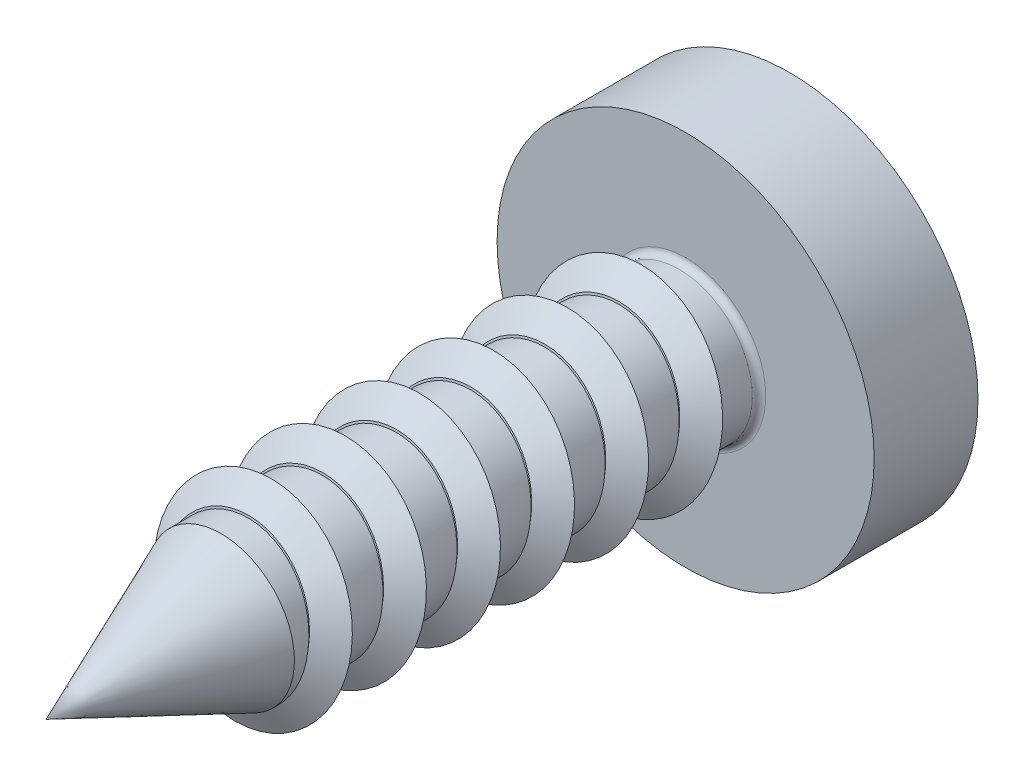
ISO-10303-21;
HEADER;
FILE_DESCRIPTION(('STEP AP214'),'2;1');
FILE_NAME('part.step','',(''),(''),'','','');
FILE_SCHEMA(('AUTOMOTIVE_DESIGN { 1 0 10303 214 1 1 1 1 }'));
ENDSEC;
DATA;
#1=APPLICATION_CONTEXT('core data for automotive mechanical design processes');
#2=APPLICATION_PROTOCOL_DEFINITION('international standard','automotive_design',2000,#1);
#3=PRODUCT_CONTEXT('',#1,'mechanical');
#4=PRODUCT('Part','Part','',(#3));
#5=PRODUCT_RELATED_PRODUCT_CATEGORY('part','',(#4));
#6=PRODUCT_DEFINITION_FORMATION('','',#4);
#7=PRODUCT_DEFINITION_CONTEXT('part definition',#1,'design');
#8=PRODUCT_DEFINITION('design','',#6,#7);
#9=PRODUCT_DEFINITION_SHAPE('','',#8);
#10=(LENGTH_UNIT() NAMED_UNIT(*) SI_UNIT(.MILLI.,.METRE.));
#11=(NAMED_UNIT(*) PLANE_ANGLE_UNIT() SI_UNIT($,.RADIAN.));
#12=(NAMED_UNIT(*) SI_UNIT($,.STERADIAN.) SOLID_ANGLE_UNIT());
#13=UNCERTAINTY_MEASURE_WITH_UNIT(LENGTH_MEASURE(1.E-05),#10,'distance_accuracy_value','');
#14=(GEOMETRIC_REPRESENTATION_CONTEXT(3) GLOBAL_UNCERTAINTY_ASSIGNED_CONTEXT((#13)) GLOBAL_UNIT_ASSIGNED_CONTEXT((#10,
#11,#12)) REPRESENTATION_CONTEXT('',''));
#15=CARTESIAN_POINT('',(0.,0.,0.));
#16=DIRECTION('',(0.,0.,1.));
#17=DIRECTION('',(1.,0.,0.));
#18=AXIS2_PLACEMENT_3D('',#15,#16,#17);
#19=CARTESIAN_POINT('',(-1.244325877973,-1.244325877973,-0.95));
#20=DIRECTION('',(0.,0.,1.));
#21=DIRECTION('',(1.,0.,0.));
#22=AXIS2_PLACEMENT_3D('',#19,#20,#21);
#23=PLANE('',#22);
#24=DIRECTION('',(-1.,0.,0.));
#25=VECTOR('',#24,1.);
#26=CARTESIAN_POINT('',(-0.78943098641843,-0.119325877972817,-0.950000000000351));
#27=LINE('',#26,#25);
#28=CARTESIAN_POINT('',(-0.119325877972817,-0.119325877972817,-0.950000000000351));
#29=VERTEX_POINT('',#28);
#30=CARTESIAN_POINT('',(-1.24432587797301,-0.119325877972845,-0.950000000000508));
#31=VERTEX_POINT('',#30);
#32=EDGE_CURVE('E293',#29,#31,#27,.T.);
#33=ORIENTED_EDGE('',*,*,#32,.T.);
#34=DIRECTION('',(0.,1.,0.));
#35=VECTOR('',#34,1.);
#36=CARTESIAN_POINT('',(-1.24432587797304,0.,-0.950000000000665));
#37=LINE('',#36,#35);
#38=CARTESIAN_POINT('',(-1.24432587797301,0.119325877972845,-0.950000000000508));
#39=VERTEX_POINT('',#38);
#40=EDGE_CURVE('E290',#31,#39,#37,.T.);
#41=ORIENTED_EDGE('',*,*,#40,.T.);
#42=DIRECTION('',(1.,0.,0.));
#43=VECTOR('',#42,1.);
#44=CARTESIAN_POINT('',(-0.78943098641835,0.119325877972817,-0.950000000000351));
#45=LINE('',#44,#43);
#46=CARTESIAN_POINT('',(-0.119325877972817,0.119325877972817,-0.950000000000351));
#47=VERTEX_POINT('',#46);
#48=EDGE_CURVE('E287',#39,#47,#45,.T.);
#49=ORIENTED_EDGE('',*,*,#48,.T.);
#50=DIRECTION('',(0.,1.,0.));
#51=VECTOR('',#50,1.);
#52=CARTESIAN_POINT('',(-0.119325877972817,0.78943098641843,-0.950000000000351));
#53=LINE('',#52,#51);
#54=CARTESIAN_POINT('',(-0.119325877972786,1.2443258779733,-0.950000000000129));
#55=VERTEX_POINT('',#54);
#56=EDGE_CURVE('E283',#47,#55,#53,.T.);
#57=ORIENTED_EDGE('',*,*,#56,.T.);
#58=DIRECTION('',(1.,0.,0.));
#59=VECTOR('',#58,1.);
#60=CARTESIAN_POINT('',(0.,1.24432587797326,-0.949999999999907));
#61=LINE('',#60,#59);
#62=CARTESIAN_POINT('',(0.119325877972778,1.2443258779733,-0.950000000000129));
#63=VERTEX_POINT('',#62);
#64=EDGE_CURVE('E279',#55,#63,#61,.T.);
#65=ORIENTED_EDGE('',*,*,#64,.T.);
#66=DIRECTION('',(0.,-1.,0.));
#67=VECTOR('',#66,1.);
#68=CARTESIAN_POINT('',(0.119325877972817,0.78943098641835,-0.950000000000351));
#69=LINE('',#68,#67);
#70=CARTESIAN_POINT('',(0.119325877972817,0.119325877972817,-0.950000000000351));
#71=VERTEX_POINT('',#70);
#72=EDGE_CURVE('E191',#63,#71,#69,.T.);
#73=ORIENTED_EDGE('',*,*,#72,.T.);
#74=DIRECTION('',(1.,0.,0.));
#75=VECTOR('',#74,1.);
#76=CARTESIAN_POINT('',(0.78943098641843,0.119325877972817,-0.950000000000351));
#77=LINE('',#76,#75);
#78=CARTESIAN_POINT('',(1.24432587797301,0.119325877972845,-0.950000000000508));
#79=VERTEX_POINT('',#78);
#80=EDGE_CURVE('E188',#71,#79,#77,.T.);
#81=ORIENTED_EDGE('',*,*,#80,.T.);
#82=DIRECTION('',(0.,-1.,0.));
#83=VECTOR('',#82,1.);
#84=CARTESIAN_POINT('',(1.24432587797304,0.,-0.950000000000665));
#85=LINE('',#84,#83);
#86=CARTESIAN_POINT('',(1.24432587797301,-0.119325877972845,-0.950000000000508));
#87=VERTEX_POINT('',#86);
#88=EDGE_CURVE('E310',#79,#87,#85,.T.);
#89=ORIENTED_EDGE('',*,*,#88,.T.);
#90=DIRECTION('',(-1.,0.,0.));
#91=VECTOR('',#90,1.);
#92=CARTESIAN_POINT('',(0.78943098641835,-0.119325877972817,-0.950000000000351));
#93=LINE('',#92,#91);
#94=CARTESIAN_POINT('',(0.119325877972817,-0.119325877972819,-0.950000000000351));
#95=VERTEX_POINT('',#94);
#96=EDGE_CURVE('E306',#87,#95,#93,.T.);
#97=ORIENTED_EDGE('',*,*,#96,.T.);
#98=DIRECTION('',(0.,-1.,0.));
#99=VECTOR('',#98,1.);
#100=CARTESIAN_POINT('',(0.119325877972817,-0.78943098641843,-0.950000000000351));
#101=LINE('',#100,#99);
#102=CARTESIAN_POINT('',(0.119325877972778,-1.2443258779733,-0.950000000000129));
#103=VERTEX_POINT('',#102);
#104=EDGE_CURVE('E302',#95,#103,#101,.T.);
#105=ORIENTED_EDGE('',*,*,#104,.T.);
#106=DIRECTION('',(-1.,0.,0.));
#107=VECTOR('',#106,1.);
#108=CARTESIAN_POINT('',(0.,-1.24432587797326,-0.949999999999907));
#109=LINE('',#108,#107);
#110=CARTESIAN_POINT('',(-0.119325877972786,-1.2443258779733,-0.950000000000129));
#111=VERTEX_POINT('',#110);
#112=EDGE_CURVE('E299',#103,#111,#109,.T.);
#113=ORIENTED_EDGE('',*,*,#112,.T.);
#114=DIRECTION('',(0.,1.,0.));
#115=VECTOR('',#114,1.);
#116=CARTESIAN_POINT('',(-0.119325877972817,-0.78943098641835,-0.950000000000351));
#117=LINE('',#116,#115);
#118=EDGE_CURVE('E296',#111,#29,#117,.T.);
#119=ORIENTED_EDGE('',*,*,#118,.T.);
#120=EDGE_LOOP('',(#33,#41,#49,#57,#65,#73,#81,#89,#97,#105,#113,#119));
#121=FACE_BOUND('',#120,.T.);
#122=ADVANCED_FACE('F16',(#121),#23,.F.);
#123=CARTESIAN_POINT('',(0.3701548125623,-1.459536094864,-2.372521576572));
#124=DIRECTION('',(0.984807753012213,0.,0.173648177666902));
#125=DIRECTION('',(0.,1.,0.));
#126=AXIS2_PLACEMENT_3D('',#123,#124,#125);
#127=PLANE('',#126);
#128=ORIENTED_EDGE('',*,*,#104,.F.);
#129=DIRECTION('',(0.171087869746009,-0.171087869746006,-0.970287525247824));
#130=VECTOR('',#129,1.);
#131=CARTESIAN_POINT('',(0.119325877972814,-0.119325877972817,-0.950000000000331));
#132=LINE('',#131,#130);
#133=CARTESIAN_POINT('',(0.370154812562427,-0.370154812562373,-2.37252157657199));
#134=VERTEX_POINT('',#133);
#135=EDGE_CURVE('E282',#95,#134,#132,.T.);
#136=ORIENTED_EDGE('',*,*,#135,.T.);
#137=CARTESIAN_POINT('',(0.370154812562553,-0.370154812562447,-2.37252157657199));
#138=CARTESIAN_POINT('',(0.369555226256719,-0.416436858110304,-2.36912115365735));
#139=CARTESIAN_POINT('',(0.368843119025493,-0.462670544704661,-2.36508259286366));
#140=CARTESIAN_POINT('',(0.367196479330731,-0.554897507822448,-2.35574403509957));
#141=CARTESIAN_POINT('',(0.366262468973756,-0.600891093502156,-2.35044699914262));
#142=CARTESIAN_POINT('',(0.364173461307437,-0.692638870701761,-2.33859964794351));
#143=CARTESIAN_POINT('',(0.363018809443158,-0.738393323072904,-2.33205129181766));
#144=CARTESIAN_POINT('',(0.360489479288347,-0.829663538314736,-2.31770674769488));
#145=CARTESIAN_POINT('',(0.359114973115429,-0.875179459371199,-2.30991153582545));
#146=CARTESIAN_POINT('',(0.356146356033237,-0.965973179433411,-2.29307567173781));
#147=CARTESIAN_POINT('',(0.354552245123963,-1.01125097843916,-2.28403501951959));
#148=CARTESIAN_POINT('',(0.351144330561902,-1.10156852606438,-2.26470777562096));
#149=CARTESIAN_POINT('',(0.349330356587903,-1.14660806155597,-2.25442021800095));
#150=CARTESIAN_POINT('',(0.34548211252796,-1.23644826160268,-2.23259574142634));
#151=CARTESIAN_POINT('',(0.343447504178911,-1.28124844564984,-2.22105690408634));
#152=CARTESIAN_POINT('',(0.339156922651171,-1.37060852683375,-2.19672380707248));
#153=CARTESIAN_POINT('',(0.336900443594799,-1.41516761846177,-2.18392667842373));
#154=CARTESIAN_POINT('',(0.334536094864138,-1.45953609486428,-2.17051779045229));
#155=B_SPLINE_CURVE_WITH_KNOTS('',3,(#137,#138,#139,#140,#141,#142,#143,#144,#145,#146,#147,
#148,#149,#150,#151,#152,#153,#154),.UNSPECIFIED.,.F.,.F.,(4,2,2,2,2,2,2,2,4),(0.,
0.139227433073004,0.278130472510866,0.416817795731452,0.555397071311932,0.693976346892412,
0.832663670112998,0.97156670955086,1.11079414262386),.UNSPECIFIED.);
#156=CARTESIAN_POINT('',(0.334536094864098,-1.45953609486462,-2.17051779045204));
#157=VERTEX_POINT('',#156);
#158=EDGE_CURVE('E207',#134,#157,#155,.T.);
#159=ORIENTED_EDGE('',*,*,#158,.T.);
#160=DIRECTION('',(-0.171087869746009,0.171087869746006,0.970287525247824));
#161=VECTOR('',#160,1.);
#162=CARTESIAN_POINT('',(0.334536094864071,-1.45953609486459,-2.17051779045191));
#163=LINE('',#162,#161);
#164=EDGE_CURVE('E301',#157,#103,#163,.T.);
#165=ORIENTED_EDGE('',*,*,#164,.T.);
#166=EDGE_LOOP('',(#128,#136,#159,#165));
#167=FACE_BOUND('',#166,.T.);
#168=ADVANCED_FACE('F689',(#167),#127,.F.);
#169=CARTESIAN_POINT('',(0.3701548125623,0.1193258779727,-2.372521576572));
#170=DIRECTION('',(0.984807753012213,0.,0.173648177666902));
#171=DIRECTION('',(0.,1.,0.));
#172=AXIS2_PLACEMENT_3D('',#169,#170,#171);
#173=PLANE('',#172);
#174=ORIENTED_EDGE('',*,*,#72,.F.);
#175=DIRECTION('',(0.171087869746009,0.171087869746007,-0.970287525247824));
#176=VECTOR('',#175,1.);
#177=CARTESIAN_POINT('',(0.119325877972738,1.24432587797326,-0.949999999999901));
#178=LINE('',#177,#176);
#179=CARTESIAN_POINT('',(0.334536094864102,1.45953609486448,-2.17051779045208));
#180=VERTEX_POINT('',#179);
#181=EDGE_CURVE('E206',#63,#180,#178,.T.);
#182=ORIENTED_EDGE('',*,*,#181,.T.);
#183=CARTESIAN_POINT('',(0.334536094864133,1.45953609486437,-2.17051779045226));
#184=CARTESIAN_POINT('',(0.336900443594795,1.41516761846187,-2.1839266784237));
#185=CARTESIAN_POINT('',(0.339156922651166,1.37060852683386,-2.19672380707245));
#186=CARTESIAN_POINT('',(0.343447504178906,1.28124844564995,-2.22105690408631));
#187=CARTESIAN_POINT('',(0.345482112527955,1.23644826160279,-2.23259574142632));
#188=CARTESIAN_POINT('',(0.349330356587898,1.14660806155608,-2.25442021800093));
#189=CARTESIAN_POINT('',(0.351144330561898,1.10156852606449,-2.26470777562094));
#190=CARTESIAN_POINT('',(0.354552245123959,1.01125097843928,-2.28403501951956));
#191=CARTESIAN_POINT('',(0.356146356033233,0.965973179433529,-2.29307567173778));
#192=CARTESIAN_POINT('',(0.359114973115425,0.87517945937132,-2.30991153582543));
#193=CARTESIAN_POINT('',(0.360489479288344,0.829663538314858,-2.31770674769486));
#194=CARTESIAN_POINT('',(0.363018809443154,0.73839332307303,-2.33205129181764));
#195=CARTESIAN_POINT('',(0.364173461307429,0.692638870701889,-2.33859964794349));
#196=CARTESIAN_POINT('',(0.366262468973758,0.600891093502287,-2.3504469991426));
#197=CARTESIAN_POINT('',(0.367196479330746,0.554897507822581,-2.35574403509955));
#198=CARTESIAN_POINT('',(0.368843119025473,0.462670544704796,-2.36508259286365));
#199=CARTESIAN_POINT('',(0.369555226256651,0.416436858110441,-2.36912115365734));
#200=CARTESIAN_POINT('',(0.370154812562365,0.370154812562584,-2.37252157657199));
#201=B_SPLINE_CURVE_WITH_KNOTS('',3,(#183,#184,#185,#186,#187,#188,#189,#190,#191,#192,#193,
#194,#195,#196,#197,#198,#199,#200),.UNSPECIFIED.,.F.,.F.,(4,2,2,2,2,2,2,2,4),(0.,
0.139227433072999,0.278130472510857,0.416817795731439,0.555397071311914,0.693976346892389,
0.832663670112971,0.971566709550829,1.11079414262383),.UNSPECIFIED.);
#202=CARTESIAN_POINT('',(0.370154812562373,0.370154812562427,-2.37252157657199));
#203=VERTEX_POINT('',#202);
#204=EDGE_CURVE('E198',#180,#203,#201,.T.);
#205=ORIENTED_EDGE('',*,*,#204,.T.);
#206=DIRECTION('',(-0.171087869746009,-0.17108786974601,0.970287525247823));
#207=VECTOR('',#206,1.);
#208=CARTESIAN_POINT('',(0.3701548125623,0.3701548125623,-2.372521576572));
#209=LINE('',#208,#207);
#210=EDGE_CURVE('E183',#203,#71,#209,.T.);
#211=ORIENTED_EDGE('',*,*,#210,.T.);
#212=EDGE_LOOP('',(#174,#182,#205,#211));
#213=FACE_BOUND('',#212,.T.);
#214=ADVANCED_FACE('F204',(#213),#173,.F.);
#215=CARTESIAN_POINT('',(1.459536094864,0.3701548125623,-2.372521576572));
#216=DIRECTION('',(0.,0.984807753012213,0.173648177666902));
#217=DIRECTION('',(-1.,0.,0.));
#218=AXIS2_PLACEMENT_3D('',#215,#216,#217);
#219=PLANE('',#218);
#220=ORIENTED_EDGE('',*,*,#80,.F.);
#221=ORIENTED_EDGE('',*,*,#210,.F.);
#222=CARTESIAN_POINT('',(0.370154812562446,0.370154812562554,-2.37252157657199));
#223=CARTESIAN_POINT('',(0.416436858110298,0.369555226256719,-2.36912115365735));
#224=CARTESIAN_POINT('',(0.462670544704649,0.368843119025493,-2.36508259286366));
#225=CARTESIAN_POINT('',(0.554897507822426,0.367196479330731,-2.35574403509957));
#226=CARTESIAN_POINT('',(0.600891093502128,0.366262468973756,-2.35044699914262));
#227=CARTESIAN_POINT('',(0.692638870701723,0.364173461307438,-2.33859964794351));
#228=CARTESIAN_POINT('',(0.73839332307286,0.36301880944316,-2.33205129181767));
#229=CARTESIAN_POINT('',(0.829663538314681,0.360489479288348,-2.31770674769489));
#230=CARTESIAN_POINT('',(0.875179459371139,0.359114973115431,-2.30991153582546));
#231=CARTESIAN_POINT('',(0.965973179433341,0.35614635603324,-2.29307567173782));
#232=CARTESIAN_POINT('',(1.01125097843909,0.354552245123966,-2.2840350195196));
#233=CARTESIAN_POINT('',(1.10156852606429,0.351144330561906,-2.26470777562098));
#234=CARTESIAN_POINT('',(1.14660806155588,0.349330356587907,-2.25442021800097));
#235=CARTESIAN_POINT('',(1.23644826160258,0.345482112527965,-2.23259574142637));
#236=CARTESIAN_POINT('',(1.28124844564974,0.343447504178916,-2.22105690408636));
#237=CARTESIAN_POINT('',(1.37060852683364,0.339156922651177,-2.19672380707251));
#238=CARTESIAN_POINT('',(1.41516761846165,0.336900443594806,-2.18392667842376));
#239=CARTESIAN_POINT('',(1.45953609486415,0.334536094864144,-2.17051779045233));
#240=B_SPLINE_CURVE_WITH_KNOTS('',3,(#222,#223,#224,#225,#226,#227,#228,#229,#230,#231,#232,
#233,#234,#235,#236,#237,#238,#239),.UNSPECIFIED.,.F.,.F.,(4,2,2,2,2,2,2,2,4),(0.,
0.139227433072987,0.278130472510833,0.416817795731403,0.555397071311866,0.69397634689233,
0.8326636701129,0.971566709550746,1.11079414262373),.UNSPECIFIED.);
#241=CARTESIAN_POINT('',(1.45953609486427,0.334536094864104,-2.17051779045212));
#242=VERTEX_POINT('',#241);
#243=EDGE_CURVE('E187',#203,#242,#240,.T.);
#244=ORIENTED_EDGE('',*,*,#243,.T.);
#245=DIRECTION('',(-0.171087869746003,-0.171087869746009,0.970287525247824));
#246=VECTOR('',#245,1.);
#247=CARTESIAN_POINT('',(1.45953609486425,0.334536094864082,-2.17051779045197));
#248=LINE('',#247,#246);
#249=EDGE_CURVE('E312',#242,#79,#248,.T.);
#250=ORIENTED_EDGE('',*,*,#249,.T.);
#251=EDGE_LOOP('',(#220,#221,#244,#250));
#252=FACE_BOUND('',#251,.T.);
#253=ADVANCED_FACE('F185',(#252),#219,.F.);
#254=CARTESIAN_POINT('',(1.46366797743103,-0.3345360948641,-2.19395086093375));
#255=DIRECTION('',(0.984807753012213,0.,0.173648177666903));
#256=DIRECTION('',(0.,1.,0.));
#257=AXIS2_PLACEMENT_3D('',#254,#255,#256);
#258=PLANE('',#257);
#259=ORIENTED_EDGE('',*,*,#88,.F.);
#260=ORIENTED_EDGE('',*,*,#249,.F.);
#261=CARTESIAN_POINT('',(1.4595360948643,0.334536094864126,-2.17051779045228));
#262=CARTESIAN_POINT('',(1.46084288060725,0.223024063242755,-2.1779289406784));
#263=CARTESIAN_POINT('',(1.46149627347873,0.111512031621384,-2.18163451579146));
#264=CARTESIAN_POINT('',(1.46149627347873,-0.111512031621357,-2.18163451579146));
#265=CARTESIAN_POINT('',(1.46084288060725,-0.223024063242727,-2.1779289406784));
#266=CARTESIAN_POINT('',(1.4595360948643,-0.334536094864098,-2.17051779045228));
#267=B_SPLINE_CURVE_WITH_KNOTS('',3,(#261,#262,#263,#264,#265,#266),.UNSPECIFIED.,.F.,.F.,(4,2,
4),(0.,0.334726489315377,0.669452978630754),.UNSPECIFIED.);
#268=CARTESIAN_POINT('',(1.45953609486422,-0.334536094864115,-2.17051779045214));
#269=VERTEX_POINT('',#268);
#270=EDGE_CURVE('E201',#242,#269,#267,.T.);
#271=ORIENTED_EDGE('',*,*,#270,.T.);
#272=DIRECTION('',(-0.171087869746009,0.171087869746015,0.970287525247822));
#273=VECTOR('',#272,1.);
#274=CARTESIAN_POINT('',(1.45953609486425,-0.334536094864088,-2.17051779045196));
#275=LINE('',#274,#273);
#276=EDGE_CURVE('E309',#269,#87,#275,.T.);
#277=ORIENTED_EDGE('',*,*,#276,.T.);
#278=EDGE_LOOP('',(#259,#260,#271,#277));
#279=FACE_BOUND('',#278,.T.);
#280=ADVANCED_FACE('F624',(#279),#258,.F.);
#281=CARTESIAN_POINT('',(0.1193258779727,-0.3701548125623,-2.372521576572));
#282=DIRECTION('',(0.,-0.984807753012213,0.173648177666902));
#283=DIRECTION('',(1.,0.,0.));
#284=AXIS2_PLACEMENT_3D('',#281,#282,#283);
#285=PLANE('',#284);
#286=ORIENTED_EDGE('',*,*,#96,.F.);
#287=ORIENTED_EDGE('',*,*,#276,.F.);
#288=CARTESIAN_POINT('',(1.45953609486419,-0.334536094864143,-2.17051779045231));
#289=CARTESIAN_POINT('',(1.4151676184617,-0.336900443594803,-2.18392667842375));
#290=CARTESIAN_POINT('',(1.37060852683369,-0.339156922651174,-2.19672380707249));
#291=CARTESIAN_POINT('',(1.2812484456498,-0.343447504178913,-2.22105690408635));
#292=CARTESIAN_POINT('',(1.23644826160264,-0.345482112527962,-2.23259574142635));
#293=CARTESIAN_POINT('',(1.14660806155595,-0.349330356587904,-2.25442021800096));
#294=CARTESIAN_POINT('',(1.10156852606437,-0.351144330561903,-2.26470777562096));
#295=CARTESIAN_POINT('',(1.01125097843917,-0.354552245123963,-2.28403501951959));
#296=CARTESIAN_POINT('',(0.965973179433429,-0.356146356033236,-2.2930756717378));
#297=CARTESIAN_POINT('',(0.875179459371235,-0.359114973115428,-2.30991153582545));
#298=CARTESIAN_POINT('',(0.829663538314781,-0.360489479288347,-2.31770674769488));
#299=CARTESIAN_POINT('',(0.738393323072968,-0.363018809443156,-2.33205129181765));
#300=CARTESIAN_POINT('',(0.692638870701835,-0.364173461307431,-2.3385996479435));
#301=CARTESIAN_POINT('',(0.600891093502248,-0.366262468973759,-2.35044699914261));
#302=CARTESIAN_POINT('',(0.554897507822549,-0.367196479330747,-2.35574403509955));
#303=CARTESIAN_POINT('',(0.46267054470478,-0.368843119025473,-2.36508259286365));
#304=CARTESIAN_POINT('',(0.416436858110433,-0.36955522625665,-2.36912115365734));
#305=CARTESIAN_POINT('',(0.370154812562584,-0.370154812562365,-2.37252157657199));
#306=B_SPLINE_CURVE_WITH_KNOTS('',3,(#288,#289,#290,#291,#292,#293,#294,#295,#296,#297,#298,
#299,#300,#301,#302,#303,#304,#305),.UNSPECIFIED.,.F.,.F.,(4,2,2,2,2,2,2,2,4),(0.,
0.139227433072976,0.27813047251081,0.416817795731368,0.55539707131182,0.693976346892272,
0.83266367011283,0.971566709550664,1.11079414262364),.UNSPECIFIED.);
#307=EDGE_CURVE('E627',#269,#134,#306,.T.);
#308=ORIENTED_EDGE('',*,*,#307,.T.);
#309=ORIENTED_EDGE('',*,*,#135,.F.);
#310=EDGE_LOOP('',(#286,#287,#308,#309));
#311=FACE_BOUND('',#310,.T.);
#312=ADVANCED_FACE('F619',(#311),#285,.F.);
#313=CARTESIAN_POINT('',(0.3345360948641,1.461496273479,-2.181634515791));
#314=DIRECTION('',(0.,0.984807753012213,0.173648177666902));
#315=DIRECTION('',(-1.,0.,0.));
#316=AXIS2_PLACEMENT_3D('',#313,#314,#315);
#317=PLANE('',#316);
#318=ORIENTED_EDGE('',*,*,#181,.F.);
#319=ORIENTED_EDGE('',*,*,#64,.F.);
#320=DIRECTION('',(-0.171087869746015,0.171087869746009,-0.970287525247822));
#321=VECTOR('',#320,1.);
#322=CARTESIAN_POINT('',(-0.119325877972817,1.24432587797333,-0.950000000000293));
#323=LINE('',#322,#321);
#324=CARTESIAN_POINT('',(-0.334536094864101,1.45953609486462,-2.17051779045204));
#325=VERTEX_POINT('',#324);
#326=EDGE_CURVE('E210',#55,#325,#323,.T.);
#327=ORIENTED_EDGE('',*,*,#326,.T.);
#328=CARTESIAN_POINT('',(-0.334536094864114,1.45953609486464,-2.17051779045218));
#329=CARTESIAN_POINT('',(-0.223024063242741,1.46084288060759,-2.17792894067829));
#330=CARTESIAN_POINT('',(-0.111512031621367,1.46149627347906,-2.18163451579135));
#331=CARTESIAN_POINT('',(0.11151203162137,1.46149627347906,-2.18163451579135));
#332=CARTESIAN_POINT('',(0.223024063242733,1.46084288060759,-2.1779289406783));
#333=CARTESIAN_POINT('',(0.334536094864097,1.45953609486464,-2.17051779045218));
#334=B_SPLINE_CURVE_WITH_KNOTS('',3,(#328,#329,#330,#331,#332,#333),.UNSPECIFIED.,.F.,.F.,(4,2,
4),(0.,0.334726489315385,0.669452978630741),.UNSPECIFIED.);
#335=EDGE_CURVE('E605',#325,#180,#334,.T.);
#336=ORIENTED_EDGE('',*,*,#335,.T.);
#337=EDGE_LOOP('',(#318,#319,#327,#336));
#338=FACE_BOUND('',#337,.T.);
#339=ADVANCED_FACE('F614',(#338),#317,.F.);
#340=CARTESIAN_POINT('',(-0.3345360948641,-1.461496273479,-2.181634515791));
#341=DIRECTION('',(0.,-0.984807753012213,0.173648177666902));
#342=DIRECTION('',(1.,0.,0.));
#343=AXIS2_PLACEMENT_3D('',#340,#341,#342);
#344=PLANE('',#343);
#345=ORIENTED_EDGE('',*,*,#112,.F.);
#346=ORIENTED_EDGE('',*,*,#164,.F.);
#347=CARTESIAN_POINT('',(0.334536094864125,-1.45953609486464,-2.17051779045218));
#348=CARTESIAN_POINT('',(0.223024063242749,-1.46084288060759,-2.1779289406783));
#349=CARTESIAN_POINT('',(0.111512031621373,-1.46149627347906,-2.18163451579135));
#350=CARTESIAN_POINT('',(-0.111512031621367,-1.46149627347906,-2.18163451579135));
#351=CARTESIAN_POINT('',(-0.22302406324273,-1.46084288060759,-2.1779289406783));
#352=CARTESIAN_POINT('',(-0.334536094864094,-1.45953609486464,-2.17051779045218));
#353=B_SPLINE_CURVE_WITH_KNOTS('',3,(#347,#348,#349,#350,#351,#352),.UNSPECIFIED.,.F.,.F.,(4,2,
4),(0.,0.334726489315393,0.669452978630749),.UNSPECIFIED.);
#354=CARTESIAN_POINT('',(-0.334536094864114,-1.45953609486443,-2.1705177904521));
#355=VERTEX_POINT('',#354);
#356=EDGE_CURVE('E599',#157,#355,#353,.T.);
#357=ORIENTED_EDGE('',*,*,#356,.T.);
#358=DIRECTION('',(0.171087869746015,0.171087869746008,0.970287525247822));
#359=VECTOR('',#358,1.);
#360=CARTESIAN_POINT('',(-0.334536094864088,-1.45953609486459,-2.1705177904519));
#361=LINE('',#360,#359);
#362=EDGE_CURVE('E298',#355,#111,#361,.T.);
#363=ORIENTED_EDGE('',*,*,#362,.T.);
#364=EDGE_LOOP('',(#345,#346,#357,#363));
#365=FACE_BOUND('',#364,.T.);
#366=ADVANCED_FACE('F611',(#365),#344,.F.);
#367=CARTESIAN_POINT('',(-0.3701548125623,-0.1193258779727,-2.372521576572));
#368=DIRECTION('',(-0.984807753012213,0.,0.173648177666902));
#369=DIRECTION('',(0.,-1.,0.));
#370=AXIS2_PLACEMENT_3D('',#367,#368,#369);
#371=PLANE('',#370);
#372=ORIENTED_EDGE('',*,*,#118,.F.);
#373=ORIENTED_EDGE('',*,*,#362,.F.);
#374=CARTESIAN_POINT('',(-0.33453609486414,-1.45953609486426,-2.17051779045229));
#375=CARTESIAN_POINT('',(-0.3369004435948,-1.41516761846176,-2.18392667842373));
#376=CARTESIAN_POINT('',(-0.339156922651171,-1.37060852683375,-2.19672380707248));
#377=CARTESIAN_POINT('',(-0.34344750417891,-1.28124844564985,-2.22105690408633));
#378=CARTESIAN_POINT('',(-0.34548211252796,-1.2364482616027,-2.23259574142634));
#379=CARTESIAN_POINT('',(-0.349330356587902,-1.146608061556,-2.25442021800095));
#380=CARTESIAN_POINT('',(-0.351144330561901,-1.10156852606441,-2.26470777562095));
#381=CARTESIAN_POINT('',(-0.354552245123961,-1.01125097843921,-2.28403501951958));
#382=CARTESIAN_POINT('',(-0.356146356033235,-0.965973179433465,-2.29307567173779));
#383=CARTESIAN_POINT('',(-0.359114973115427,-0.875179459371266,-2.30991153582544));
#384=CARTESIAN_POINT('',(-0.360489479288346,-0.829663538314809,-2.31770674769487));
#385=CARTESIAN_POINT('',(-0.363018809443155,-0.73839332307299,-2.33205129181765));
#386=CARTESIAN_POINT('',(-0.36417346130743,-0.692638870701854,-2.3385996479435));
#387=CARTESIAN_POINT('',(-0.366262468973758,-0.600891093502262,-2.3504469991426));
#388=CARTESIAN_POINT('',(-0.367196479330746,-0.554897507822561,-2.35574403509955));
#389=CARTESIAN_POINT('',(-0.368843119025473,-0.462670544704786,-2.36508259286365));
#390=CARTESIAN_POINT('',(-0.36955522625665,-0.416436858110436,-2.36912115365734));
#391=CARTESIAN_POINT('',(-0.370154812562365,-0.370154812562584,-2.37252157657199));
#392=B_SPLINE_CURVE_WITH_KNOTS('',3,(#374,#375,#376,#377,#378,#379,#380,#381,#382,#383,#384,
#385,#386,#387,#388,#389,#390,#391),.UNSPECIFIED.,.F.,.F.,(4,2,2,2,2,2,2,2,4),(0.,
0.139227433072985,0.278130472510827,0.416817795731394,0.555397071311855,0.693976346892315,
0.832663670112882,0.971566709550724,1.11079414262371),.UNSPECIFIED.);
#393=CARTESIAN_POINT('',(-0.370154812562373,-0.370154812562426,-2.37252157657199));
#394=VERTEX_POINT('',#393);
#395=EDGE_CURVE('E594',#355,#394,#392,.T.);
#396=ORIENTED_EDGE('',*,*,#395,.T.);
#397=DIRECTION('',(0.171087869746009,0.17108786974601,0.970287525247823));
#398=VECTOR('',#397,1.);
#399=CARTESIAN_POINT('',(-0.3701548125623,-0.3701548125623,-2.372521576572));
#400=LINE('',#399,#398);
#401=EDGE_CURVE('E295',#394,#29,#400,.T.);
#402=ORIENTED_EDGE('',*,*,#401,.T.);
#403=EDGE_LOOP('',(#372,#373,#396,#402));
#404=FACE_BOUND('',#403,.T.);
#405=ADVANCED_FACE('F584',(#404),#371,.F.);
#406=CARTESIAN_POINT('',(-1.459536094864,-0.3701548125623,-2.372521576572));
#407=DIRECTION('',(0.,-0.984807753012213,0.173648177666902));
#408=DIRECTION('',(1.,0.,0.));
#409=AXIS2_PLACEMENT_3D('',#406,#407,#408);
#410=PLANE('',#409);
#411=ORIENTED_EDGE('',*,*,#32,.F.);
#412=ORIENTED_EDGE('',*,*,#401,.F.);
#413=CARTESIAN_POINT('',(-0.370154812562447,-0.370154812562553,-2.37252157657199));
#414=CARTESIAN_POINT('',(-0.416436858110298,-0.369555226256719,-2.36912115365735));
#415=CARTESIAN_POINT('',(-0.46267054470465,-0.368843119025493,-2.36508259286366));
#416=CARTESIAN_POINT('',(-0.554897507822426,-0.367196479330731,-2.35574403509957));
#417=CARTESIAN_POINT('',(-0.600891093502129,-0.366262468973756,-2.35044699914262));
#418=CARTESIAN_POINT('',(-0.692638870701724,-0.364173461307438,-2.33859964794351));
#419=CARTESIAN_POINT('',(-0.738393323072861,-0.36301880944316,-2.33205129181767));
#420=CARTESIAN_POINT('',(-0.829663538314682,-0.360489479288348,-2.31770674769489));
#421=CARTESIAN_POINT('',(-0.87517945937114,-0.359114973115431,-2.30991153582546));
#422=CARTESIAN_POINT('',(-0.965973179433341,-0.35614635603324,-2.29307567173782));
#423=CARTESIAN_POINT('',(-1.01125097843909,-0.354552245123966,-2.2840350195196));
#424=CARTESIAN_POINT('',(-1.10156852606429,-0.351144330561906,-2.26470777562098));
#425=CARTESIAN_POINT('',(-1.14660806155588,-0.349330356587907,-2.25442021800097));
#426=CARTESIAN_POINT('',(-1.23644826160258,-0.345482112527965,-2.23259574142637));
#427=CARTESIAN_POINT('',(-1.28124844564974,-0.343447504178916,-2.22105690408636));
#428=CARTESIAN_POINT('',(-1.37060852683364,-0.339156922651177,-2.19672380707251));
#429=CARTESIAN_POINT('',(-1.41516761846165,-0.336900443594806,-2.18392667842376));
#430=CARTESIAN_POINT('',(-1.45953609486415,-0.334536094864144,-2.17051779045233));
#431=B_SPLINE_CURVE_WITH_KNOTS('',3,(#413,#414,#415,#416,#417,#418,#419,#420,#421,#422,#423,
#424,#425,#426,#427,#428,#429,#430),.UNSPECIFIED.,.F.,.F.,(4,2,2,2,2,2,2,2,4),(0.,
0.139227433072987,0.278130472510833,0.416817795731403,0.555397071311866,0.693976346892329,
0.832663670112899,0.971566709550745,1.11079414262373),.UNSPECIFIED.);
#432=CARTESIAN_POINT('',(-1.45953609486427,-0.334536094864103,-2.17051779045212));
#433=VERTEX_POINT('',#432);
#434=EDGE_CURVE('E588',#394,#433,#431,.T.);
#435=ORIENTED_EDGE('',*,*,#434,.T.);
#436=DIRECTION('',(0.171087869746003,0.171087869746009,0.970287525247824));
#437=VECTOR('',#436,1.);
#438=CARTESIAN_POINT('',(-1.45953609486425,-0.334536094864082,-2.17051779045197));
#439=LINE('',#438,#437);
#440=EDGE_CURVE('E292',#433,#31,#439,.T.);
#441=ORIENTED_EDGE('',*,*,#440,.T.);
#442=EDGE_LOOP('',(#411,#412,#435,#441));
#443=FACE_BOUND('',#442,.T.);
#444=ADVANCED_FACE('F579',(#443),#410,.F.);
#445=CARTESIAN_POINT('',(-1.46366797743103,0.3345360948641,-2.19395086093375));
#446=DIRECTION('',(-0.984807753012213,0.,0.173648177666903));
#447=DIRECTION('',(0.,-1.,0.));
#448=AXIS2_PLACEMENT_3D('',#445,#446,#447);
#449=PLANE('',#448);
#450=ORIENTED_EDGE('',*,*,#40,.F.);
#451=ORIENTED_EDGE('',*,*,#440,.F.);
#452=CARTESIAN_POINT('',(-1.4595360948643,-0.334536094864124,-2.17051779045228));
#453=CARTESIAN_POINT('',(-1.46084288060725,-0.223024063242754,-2.1779289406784));
#454=CARTESIAN_POINT('',(-1.46149627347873,-0.111512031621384,-2.18163451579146));
#455=CARTESIAN_POINT('',(-1.46149627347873,0.111512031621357,-2.18163451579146));
#456=CARTESIAN_POINT('',(-1.46084288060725,0.223024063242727,-2.1779289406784));
#457=CARTESIAN_POINT('',(-1.4595360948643,0.334536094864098,-2.17051779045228));
#458=B_SPLINE_CURVE_WITH_KNOTS('',3,(#452,#453,#454,#455,#456,#457),.UNSPECIFIED.,.F.,.F.,(4,2,
4),(0.,0.334726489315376,0.669452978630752),.UNSPECIFIED.);
#459=CARTESIAN_POINT('',(-1.45953609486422,0.334536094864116,-2.17051779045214));
#460=VERTEX_POINT('',#459);
#461=EDGE_CURVE('E565',#433,#460,#458,.T.);
#462=ORIENTED_EDGE('',*,*,#461,.T.);
#463=DIRECTION('',(0.171087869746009,-0.171087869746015,0.970287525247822));
#464=VECTOR('',#463,1.);
#465=CARTESIAN_POINT('',(-1.45953609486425,0.334536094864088,-2.17051779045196));
#466=LINE('',#465,#464);
#467=EDGE_CURVE('E289',#460,#39,#466,.T.);
#468=ORIENTED_EDGE('',*,*,#467,.T.);
#469=EDGE_LOOP('',(#450,#451,#462,#468));
#470=FACE_BOUND('',#469,.T.);
#471=ADVANCED_FACE('F574',(#470),#449,.F.);
#472=CARTESIAN_POINT('',(-0.1193258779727,0.3701548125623,-2.372521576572));
#473=DIRECTION('',(0.,0.984807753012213,0.173648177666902));
#474=DIRECTION('',(-1.,0.,0.));
#475=AXIS2_PLACEMENT_3D('',#472,#473,#474);
#476=PLANE('',#475);
#477=ORIENTED_EDGE('',*,*,#48,.F.);
#478=ORIENTED_EDGE('',*,*,#467,.F.);
#479=CARTESIAN_POINT('',(-1.45953609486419,0.334536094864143,-2.17051779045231));
#480=CARTESIAN_POINT('',(-1.4151676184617,0.336900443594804,-2.18392667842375));
#481=CARTESIAN_POINT('',(-1.37060852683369,0.339156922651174,-2.19672380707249));
#482=CARTESIAN_POINT('',(-1.2812484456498,0.343447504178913,-2.22105690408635));
#483=CARTESIAN_POINT('',(-1.23644826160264,0.345482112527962,-2.23259574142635));
#484=CARTESIAN_POINT('',(-1.14660806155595,0.349330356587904,-2.25442021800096));
#485=CARTESIAN_POINT('',(-1.10156852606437,0.351144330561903,-2.26470777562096));
#486=CARTESIAN_POINT('',(-1.01125097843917,0.354552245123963,-2.28403501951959));
#487=CARTESIAN_POINT('',(-0.965973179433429,0.356146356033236,-2.2930756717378));
#488=CARTESIAN_POINT('',(-0.875179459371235,0.359114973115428,-2.30991153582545));
#489=CARTESIAN_POINT('',(-0.829663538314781,0.360489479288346,-2.31770674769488));
#490=CARTESIAN_POINT('',(-0.738393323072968,0.363018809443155,-2.33205129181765));
#491=CARTESIAN_POINT('',(-0.692638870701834,0.364173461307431,-2.3385996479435));
#492=CARTESIAN_POINT('',(-0.600891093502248,0.366262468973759,-2.35044699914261));
#493=CARTESIAN_POINT('',(-0.554897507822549,0.367196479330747,-2.35574403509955));
#494=CARTESIAN_POINT('',(-0.462670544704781,0.368843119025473,-2.36508259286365));
#495=CARTESIAN_POINT('',(-0.416436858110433,0.36955522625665,-2.36912115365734));
#496=CARTESIAN_POINT('',(-0.370154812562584,0.370154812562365,-2.37252157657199));
#497=B_SPLINE_CURVE_WITH_KNOTS('',3,(#479,#480,#481,#482,#483,#484,#485,#486,#487,#488,#489,
#490,#491,#492,#493,#494,#495,#496),.UNSPECIFIED.,.F.,.F.,(4,2,2,2,2,2,2,2,4),(0.,
0.139227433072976,0.27813047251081,0.416817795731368,0.55539707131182,0.693976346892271,
0.83266367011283,0.971566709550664,1.11079414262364),.UNSPECIFIED.);
#498=CARTESIAN_POINT('',(-0.370154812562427,0.370154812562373,-2.37252157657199));
#499=VERTEX_POINT('',#498);
#500=EDGE_CURVE('E559',#460,#499,#497,.T.);
#501=ORIENTED_EDGE('',*,*,#500,.T.);
#502=DIRECTION('',(0.17108786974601,-0.171087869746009,0.970287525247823));
#503=VECTOR('',#502,1.);
#504=CARTESIAN_POINT('',(-0.3701548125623,0.3701548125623,-2.372521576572));
#505=LINE('',#504,#503);
#506=EDGE_CURVE('E286',#499,#47,#505,.T.);
#507=ORIENTED_EDGE('',*,*,#506,.T.);
#508=EDGE_LOOP('',(#477,#478,#501,#507));
#509=FACE_BOUND('',#508,.T.);
#510=ADVANCED_FACE('F571',(#509),#476,.F.);
#511=CARTESIAN_POINT('',(-0.3701548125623,1.459536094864,-2.372521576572));
#512=DIRECTION('',(-0.984807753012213,0.,0.173648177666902));
#513=DIRECTION('',(0.,-1.,0.));
#514=AXIS2_PLACEMENT_3D('',#511,#512,#513);
#515=PLANE('',#514);
#516=ORIENTED_EDGE('',*,*,#56,.F.);
#517=ORIENTED_EDGE('',*,*,#506,.F.);
#518=CARTESIAN_POINT('',(-0.370154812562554,0.370154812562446,-2.37252157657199));
#519=CARTESIAN_POINT('',(-0.36955522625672,0.416436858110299,-2.36912115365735));
#520=CARTESIAN_POINT('',(-0.368843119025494,0.46267054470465,-2.36508259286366));
#521=CARTESIAN_POINT('',(-0.367196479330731,0.554897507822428,-2.35574403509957));
#522=CARTESIAN_POINT('',(-0.366262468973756,0.600891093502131,-2.35044699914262));
#523=CARTESIAN_POINT('',(-0.364173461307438,0.692638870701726,-2.33859964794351));
#524=CARTESIAN_POINT('',(-0.363018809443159,0.738393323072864,-2.33205129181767));
#525=CARTESIAN_POINT('',(-0.360489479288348,0.829663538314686,-2.31770674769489));
#526=CARTESIAN_POINT('',(-0.35911497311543,0.875179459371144,-2.30991153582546));
#527=CARTESIAN_POINT('',(-0.356146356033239,0.965973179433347,-2.29307567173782));
#528=CARTESIAN_POINT('',(-0.354552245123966,1.01125097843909,-2.2840350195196));
#529=CARTESIAN_POINT('',(-0.351144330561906,1.1015685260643,-2.26470777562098));
#530=CARTESIAN_POINT('',(-0.349330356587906,1.14660806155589,-2.25442021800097));
#531=CARTESIAN_POINT('',(-0.345482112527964,1.23644826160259,-2.23259574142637));
#532=CARTESIAN_POINT('',(-0.343447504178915,1.28124844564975,-2.22105690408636));
#533=CARTESIAN_POINT('',(-0.339156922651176,1.37060852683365,-2.19672380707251));
#534=CARTESIAN_POINT('',(-0.336900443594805,1.41516761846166,-2.18392667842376));
#535=CARTESIAN_POINT('',(-0.334536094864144,1.45953609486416,-2.17051779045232));
#536=B_SPLINE_CURVE_WITH_KNOTS('',3,(#518,#519,#520,#521,#522,#523,#524,#525,#526,#527,#528,
#529,#530,#531,#532,#533,#534,#535),.UNSPECIFIED.,.F.,.F.,(4,2,2,2,2,2,2,2,4),(0.,
0.139227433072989,0.278130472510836,0.416817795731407,0.555397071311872,0.693976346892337,
0.832663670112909,0.971566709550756,1.11079414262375),.UNSPECIFIED.);
#537=EDGE_CURVE('E278',#499,#325,#536,.T.);
#538=ORIENTED_EDGE('',*,*,#537,.T.);
#539=ORIENTED_EDGE('',*,*,#326,.F.);
#540=EDGE_LOOP('',(#516,#517,#538,#539));
#541=FACE_BOUND('',#540,.T.);
#542=ADVANCED_FACE('F233',(#541),#515,.F.);
#543=CARTESIAN_POINT('',(0.,-0.5234779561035,-2.372521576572));
#544=CARTESIAN_POINT('',(0.,-1.34303119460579,-2.28624381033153));
#545=CARTESIAN_POINT('',(0.,-2.11725404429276,-2.00394903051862));
#546=CARTESIAN_POINT('',(0.,-2.80000000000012,-1.54246303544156));
#547=(BOUNDED_CURVE() B_SPLINE_CURVE(3,(#543,#544,#545,#546),.UNSPECIFIED.,.F.,
.F.) B_SPLINE_CURVE_WITH_KNOTS((4,4),(0.,1.),
.UNSPECIFIED.) CURVE() GEOMETRIC_REPRESENTATION_ITEM() RATIONAL_B_SPLINE_CURVE((1.,
0.980132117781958,0.980132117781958,1.)) REPRESENTATION_ITEM(''));
#548=CARTESIAN_POINT('',(0.,0.,2.6));
#549=DIRECTION('',(0.,0.,1.));
#550=AXIS1_PLACEMENT('',#548,#549);
#551=SURFACE_OF_REVOLUTION('',#547,#550);
#552=CARTESIAN_POINT('',(0.,0.,-1.542463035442));
#553=DIRECTION('',(0.,0.,1.));
#554=DIRECTION('',(0.,-1.,0.));
#555=AXIS2_PLACEMENT_3D('',#552,#553,#554);
#556=CIRCLE('',#555,2.8);
#557=CARTESIAN_POINT('',(0.,-2.8,-1.542463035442));
#558=VERTEX_POINT('',#557);
#559=EDGE_CURVE('E269',#558,#558,#556,.F.);
#560=ORIENTED_EDGE('',*,*,#559,.T.);
#561=EDGE_LOOP('',(#560));
#562=FACE_BOUND('',#561,.T.);
#563=ORIENTED_EDGE('',*,*,#500,.F.);
#564=ORIENTED_EDGE('',*,*,#461,.F.);
#565=ORIENTED_EDGE('',*,*,#434,.F.);
#566=ORIENTED_EDGE('',*,*,#395,.F.);
#567=ORIENTED_EDGE('',*,*,#356,.F.);
#568=ORIENTED_EDGE('',*,*,#158,.F.);
#569=ORIENTED_EDGE('',*,*,#307,.F.);
#570=ORIENTED_EDGE('',*,*,#270,.F.);
#571=ORIENTED_EDGE('',*,*,#243,.F.);
#572=ORIENTED_EDGE('',*,*,#204,.F.);
#573=ORIENTED_EDGE('',*,*,#335,.F.);
#574=ORIENTED_EDGE('',*,*,#537,.F.);
#575=EDGE_LOOP('',(#563,#564,#565,#566,#567,#568,#569,#570,#571,#572,#573,#574));
#576=FACE_BOUND('',#575,.T.);
#577=ADVANCED_FACE('F197',(#562,#576),#551,.T.);
#578=CARTESIAN_POINT('',(0.,0.,-1.542463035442));
#579=DIRECTION('',(0.,0.,1.));
#580=DIRECTION('',(1.,0.,0.));
#581=AXIS2_PLACEMENT_3D('',#578,#579,#580);
#582=CYLINDRICAL_SURFACE('',#581,2.8);
#583=CARTESIAN_POINT('',(0.,0.,0.));
#584=DIRECTION('',(0.,0.,1.));
#585=DIRECTION('',(1.,0.,0.));
#586=AXIS2_PLACEMENT_3D('',#583,#584,#585);
#587=CIRCLE('',#586,2.8);
#588=CARTESIAN_POINT('',(2.8,0.,0.));
#589=VERTEX_POINT('',#588);
#590=EDGE_CURVE('E277',#589,#589,#587,.F.);
#591=ORIENTED_EDGE('',*,*,#590,.T.);
#592=EDGE_LOOP('',(#591));
#593=FACE_BOUND('',#592,.T.);
#594=ORIENTED_EDGE('',*,*,#559,.F.);
#595=EDGE_LOOP('',(#594));
#596=FACE_BOUND('',#595,.T.);
#597=ADVANCED_FACE('F232',(#593,#596),#582,.T.);
#598=CARTESIAN_POINT('',(-2.856,2.8,0.));
#599=DIRECTION('',(0.,0.,1.));
#600=DIRECTION('',(0.,-1.,0.));
#601=AXIS2_PLACEMENT_3D('',#598,#599,#600);
#602=PLANE('',#601);
#603=CARTESIAN_POINT('',(0.,0.,0.));
#604=DIRECTION('',(0.,0.,1.));
#605=DIRECTION('',(0.,1.,0.));
#606=AXIS2_PLACEMENT_3D('',#603,#604,#605);
#607=CIRCLE('',#606,1.19);
#608=CARTESIAN_POINT('',(0.,-1.19,0.));
#609=VERTEX_POINT('',#608);
#610=CARTESIAN_POINT('',(0.,1.19,0.));
#611=VERTEX_POINT('',#610);
#612=EDGE_CURVE('E317',#609,#611,#607,.F.);
#613=ORIENTED_EDGE('',*,*,#612,.T.);
#614=CARTESIAN_POINT('',(0.,0.,0.));
#615=DIRECTION('',(0.,0.,1.));
#616=DIRECTION('',(0.,-1.,0.));
#617=AXIS2_PLACEMENT_3D('',#614,#615,#616);
#618=CIRCLE('',#617,1.19);
#619=EDGE_CURVE('E553',#611,#609,#618,.F.);
#620=ORIENTED_EDGE('',*,*,#619,.T.);
#621=EDGE_LOOP('',(#613,#620));
#622=FACE_BOUND('',#621,.T.);
#623=ORIENTED_EDGE('',*,*,#590,.F.);
#624=EDGE_LOOP('',(#623));
#625=FACE_BOUND('',#624,.T.);
#626=ADVANCED_FACE('F257',(#622,#625),#602,.T.);
#627=CARTESIAN_POINT('',(0.,-1.09,0.1));
#628=CARTESIAN_POINT('',(0.,-1.09,0.0414213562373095));
#629=CARTESIAN_POINT('',(0.,-1.13142135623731,0.));
#630=CARTESIAN_POINT('',(0.,-1.19,0.));
#631=(BOUNDED_CURVE() B_SPLINE_CURVE(3,(#627,#628,#629,#630),.UNSPECIFIED.,.F.,
.F.) B_SPLINE_CURVE_WITH_KNOTS((4,4),(0.,1.),
.UNSPECIFIED.) CURVE() GEOMETRIC_REPRESENTATION_ITEM() RATIONAL_B_SPLINE_CURVE((1.,
0.804737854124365,0.804737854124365,1.)) REPRESENTATION_ITEM(''));
#632=CARTESIAN_POINT('',(0.,0.,0.1));
#633=DIRECTION('',(0.,0.,1.));
#634=AXIS1_PLACEMENT('',#632,#633);
#635=SURFACE_OF_REVOLUTION('',#631,#634);
#636=CARTESIAN_POINT('',(0.,0.,0.0999999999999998));
#637=DIRECTION('',(0.,0.,1.));
#638=DIRECTION('',(0.,-1.,0.));
#639=AXIS2_PLACEMENT_3D('',#636,#637,#638);
#640=CIRCLE('',#639,1.09);
#641=CARTESIAN_POINT('',(0.,-1.09,0.1));
#642=VERTEX_POINT('',#641);
#643=EDGE_CURVE('E550',#642,#642,#640,.F.);
#644=ORIENTED_EDGE('',*,*,#643,.T.);
#645=EDGE_LOOP('',(#644));
#646=FACE_BOUND('',#645,.T.);
#647=ORIENTED_EDGE('',*,*,#612,.F.);
#648=ORIENTED_EDGE('',*,*,#619,.F.);
#649=EDGE_LOOP('',(#647,#648));
#650=FACE_BOUND('',#649,.T.);
#651=ADVANCED_FACE('F252',(#646,#650),#635,.F.);
#652=CARTESIAN_POINT('',(0.,0.,0.1));
#653=DIRECTION('',(0.,0.,1.));
#654=DIRECTION('',(1.,0.,0.));
#655=AXIS2_PLACEMENT_3D('',#652,#653,#654);
#656=CYLINDRICAL_SURFACE('',#655,1.09);
#657=ORIENTED_EDGE('',*,*,#643,.F.);
#658=EDGE_LOOP('',(#657));
#659=FACE_BOUND('',#658,.T.);
#660=CARTESIAN_POINT('',(-1.08969349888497,-0.0258472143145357,0.650000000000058));
#661=CARTESIAN_POINT('',(-1.09091331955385,0.0248001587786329,0.642271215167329));
#662=CARTESIAN_POINT('',(-1.08856508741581,0.0755218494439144,0.634586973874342));
#663=CARTESIAN_POINT('',(-1.07684973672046,0.176229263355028,0.619426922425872));
#664=CARTESIAN_POINT('',(-1.06747605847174,0.226214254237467,0.611951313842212));
#665=CARTESIAN_POINT('',(-1.03899447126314,0.335308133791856,0.595730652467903));
#666=CARTESIAN_POINT('',(-1.0181947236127,0.393995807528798,0.587069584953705));
#667=CARTESIAN_POINT('',(-0.966873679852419,0.507061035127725,0.570484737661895));
#668=CARTESIAN_POINT('',(-0.93635183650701,0.56143834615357,0.562560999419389));
#669=CARTESIAN_POINT('',(-0.866638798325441,0.663969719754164,0.547695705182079));
#670=CARTESIAN_POINT('',(-0.827502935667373,0.712160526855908,0.540748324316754));
#671=CARTESIAN_POINT('',(-0.741533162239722,0.801287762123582,0.527950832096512));
#672=CARTESIAN_POINT('',(-0.694698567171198,0.842223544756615,0.522100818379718));
#673=CARTESIAN_POINT('',(-0.59515133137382,0.915242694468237,0.511697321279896));
#674=CARTESIAN_POINT('',(-0.542499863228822,0.947407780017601,0.507131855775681));
#675=CARTESIAN_POINT('',(-0.432463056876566,1.0024248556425,0.49933873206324));
#676=CARTESIAN_POINT('',(-0.375079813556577,1.02528094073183,0.496110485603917));
#677=CARTESIAN_POINT('',(-0.265017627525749,1.05864326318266,0.491403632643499));
#678=CARTESIAN_POINT('',(-0.212714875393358,1.0703798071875,0.489750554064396));
#679=CARTESIAN_POINT('',(-0.106941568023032,1.08605701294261,0.487543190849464));
#680=CARTESIAN_POINT('',(-0.0534713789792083,1.09000008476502,0.486988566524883));
#681=CARTESIAN_POINT('',(0.0543288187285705,1.08999991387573,0.486988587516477));
#682=CARTESIAN_POINT('',(0.108658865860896,1.08592919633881,0.487561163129));
#683=CARTESIAN_POINT('',(0.216095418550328,1.06974579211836,0.48983984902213));
#684=CARTESIAN_POINT('',(0.269201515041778,1.0576304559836,0.491546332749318));
#685=CARTESIAN_POINT('',(0.379065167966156,1.02376092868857,0.496325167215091));
#686=CARTESIAN_POINT('',(0.43552278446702,1.00104468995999,0.499533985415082));
#687=CARTESIAN_POINT('',(0.543821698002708,0.946590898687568,0.50724782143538));
#688=CARTESIAN_POINT('',(0.595661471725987,0.914850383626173,0.511753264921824));
#689=CARTESIAN_POINT('',(0.693518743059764,0.843107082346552,0.521974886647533));
#690=CARTESIAN_POINT('',(0.739507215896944,0.803065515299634,0.527696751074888));
#691=CARTESIAN_POINT('',(0.824108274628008,0.715982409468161,0.5401984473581));
#692=CARTESIAN_POINT('',(0.862721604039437,0.668941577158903,0.546978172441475));
#693=CARTESIAN_POINT('',(0.931862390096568,0.568745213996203,0.561498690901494));
#694=CARTESIAN_POINT('',(0.962313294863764,0.515538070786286,0.569247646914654));
#695=CARTESIAN_POINT('',(1.01386004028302,0.404863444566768,0.585470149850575));
#696=CARTESIAN_POINT('',(1.03495536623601,0.34739572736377,0.593943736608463));
#697=CARTESIAN_POINT('',(1.06514227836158,0.237456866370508,0.610272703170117));
#698=CARTESIAN_POINT('',(1.07543429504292,0.185301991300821,0.618066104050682));
#699=CARTESIAN_POINT('',(1.08834735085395,0.0801202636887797,0.63389033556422));
#700=CARTESIAN_POINT('',(1.09097308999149,0.027093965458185,0.641921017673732));
#701=CARTESIAN_POINT('',(1.08969349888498,-0.0258472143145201,0.650000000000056));
#702=B_SPLINE_CURVE_WITH_KNOTS('',3,(#660,#661,#662,#663,#664,#665,#666,#667,#668,#669,#670,
#671,#672,#673,#674,#675,#676,#677,#678,#679,#680,#681,#682,#683,#684,#685,#686,#687,#688,#689,
#690,#691,#692,#693,#694,#695,#696,#697,#698,#699,#700,#701),.UNSPECIFIED.,.F.,.F.,(4,2,2,2,2,2,
2,2,2,2,2,2,2,2,2,2,2,2,2,2,4),(0.,0.153590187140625,0.307323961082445,0.494988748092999,
0.682664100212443,0.869167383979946,1.05568725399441,1.24040478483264,1.42504097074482,
1.58535275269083,1.74561495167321,1.908447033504,2.0713327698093,2.25327968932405,
2.43528640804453,2.61816340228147,2.80102195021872,2.98553978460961,3.17006776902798,
3.3307072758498,3.49124827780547),.UNSPECIFIED.);
#703=CARTESIAN_POINT('',(-1.08969349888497,-0.0258472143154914,0.650000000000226));
#704=VERTEX_POINT('',#703);
#705=CARTESIAN_POINT('',(1.08969349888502,-0.0258472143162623,0.650000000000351));
#706=VERTEX_POINT('',#705);
#707=EDGE_CURVE('E542',#704,#706,#702,.T.);
#708=ORIENTED_EDGE('',*,*,#707,.T.);
#709=CARTESIAN_POINT('',(0.,0.,0.645097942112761));
#710=DIRECTION('',(0.,0.186333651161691,0.982486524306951));
#711=DIRECTION('',(0.,-0.982486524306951,0.186333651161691));
#712=AXIS2_PLACEMENT_3D('',#709,#710,#711);
#713=ELLIPSE('',#712,1.10942997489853,1.09);
#714=EDGE_CURVE('E548',#706,#704,#713,.F.);
#715=ORIENTED_EDGE('',*,*,#714,.T.);
#716=EDGE_LOOP('',(#708,#715));
#717=FACE_BOUND('',#716,.T.);
#718=ADVANCED_FACE('F256',(#659,#717),#656,.T.);
#719=CARTESIAN_POINT('',(-1.11187020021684,-0.02584721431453,0.65));
#720=DIRECTION('',(0.,0.186333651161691,0.982486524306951));
#721=DIRECTION('',(0.,-0.982486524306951,0.186333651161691));
#722=AXIS2_PLACEMENT_3D('',#719,#720,#721);
#723=PLANE('',#722);
#724=ORIENTED_EDGE('',*,*,#714,.F.);
#725=CARTESIAN_POINT('',(0.,-0.0512417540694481,0.654816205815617));
#726=DIRECTION('',(0.,0.186333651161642,0.98248652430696));
#727=DIRECTION('',(0.,-0.98248652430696,0.186333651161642));
#728=AXIS2_PLACEMENT_3D('',#725,#726,#727);
#729=CIRCLE('',#728,1.08999999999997);
#730=EDGE_CURVE('E547',#706,#704,#729,.F.);
#731=ORIENTED_EDGE('',*,*,#730,.T.);
#732=EDGE_LOOP('',(#724,#731));
#733=FACE_BOUND('',#732,.T.);
#734=ADVANCED_FACE('F334',(#733),#723,.F.);
#735=CARTESIAN_POINT('',(0.,-0.0512417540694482,0.654816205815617));
#736=DIRECTION('',(0.,0.186333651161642,0.98248652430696));
#737=DIRECTION('',(0.,-0.98248652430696,0.186333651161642));
#738=AXIS2_PLACEMENT_3D('',#735,#736,#737);
#739=CONICAL_SURFACE('',#738,1.08999999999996,0.918465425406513);
#740=CARTESIAN_POINT('',(0.,-1.85967777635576E-13,0.924999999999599));
#741=DIRECTION('',(0.,0.186333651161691,0.982486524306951));
#742=DIRECTION('',(0.,-0.982486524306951,0.186333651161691));
#743=AXIS2_PLACEMENT_3D('',#740,#741,#742);
#744=CIRCLE('',#743,1.44999999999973);
#745=CARTESIAN_POINT('',(0.,-1.424605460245,1.195183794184));
#746=VERTEX_POINT('',#745);
#747=EDGE_CURVE('E645',#746,#746,#744,.F.);
#748=ORIENTED_EDGE('',*,*,#747,.T.);
#749=EDGE_LOOP('',(#748));
#750=FACE_BOUND('',#749,.T.);
#751=ORIENTED_EDGE('',*,*,#730,.F.);
#752=ORIENTED_EDGE('',*,*,#707,.F.);
#753=EDGE_LOOP('',(#751,#752));
#754=FACE_BOUND('',#753,.T.);
#755=ADVANCED_FACE('F536',(#750,#754),#739,.T.);
#756=CARTESIAN_POINT('',(0.,-1.85950773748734E-13,0.924999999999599));
#757=DIRECTION('',(0.,-0.186333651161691,-0.982486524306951));
#758=DIRECTION('',(0.,0.982486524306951,-0.186333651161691));
#759=AXIS2_PLACEMENT_3D('',#756,#757,#758);
#760=CONICAL_SURFACE('',#759,1.44999999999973,0.918465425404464);
#761=ORIENTED_EDGE('',*,*,#747,.F.);
#762=EDGE_LOOP('',(#761));
#763=FACE_BOUND('',#762,.T.);
#764=CARTESIAN_POINT('',(1.08969349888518,0.0258472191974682,1.1999999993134));
#765=CARTESIAN_POINT('',(1.09091331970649,-0.0248001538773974,1.20772878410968));
#766=CARTESIAN_POINT('',(1.08856508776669,-0.0755218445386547,1.21541302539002));
#767=CARTESIAN_POINT('',(1.07684973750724,-0.176229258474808,1.23057307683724));
#768=CARTESIAN_POINT('',(1.06747605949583,-0.226214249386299,1.2380486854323));
#769=CARTESIAN_POINT('',(1.03899447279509,-0.335308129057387,1.25426934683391));
#770=CARTESIAN_POINT('',(1.01819472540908,-0.393995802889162,1.26293041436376));
#771=CARTESIAN_POINT('',(0.966873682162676,-0.507061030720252,1.27951526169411));
#772=CARTESIAN_POINT('',(0.936351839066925,-0.561438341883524,1.28743899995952));
#773=CARTESIAN_POINT('',(0.866638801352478,-0.663969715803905,1.30230429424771));
#774=CARTESIAN_POINT('',(0.827502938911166,-0.712160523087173,1.3092516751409));
#775=CARTESIAN_POINT('',(0.741533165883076,-0.80128775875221,1.32204916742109));
#776=CARTESIAN_POINT('',(0.69469857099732,-0.842223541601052,1.32789918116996));
#777=CARTESIAN_POINT('',(0.59515133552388,-0.915242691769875,1.33830267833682));
#778=CARTESIAN_POINT('',(0.542499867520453,-0.947407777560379,1.34286814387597));
#779=CARTESIAN_POINT('',(0.432463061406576,-1.00242485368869,1.35066126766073));
#780=CARTESIAN_POINT('',(0.375079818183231,-1.02528093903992,1.35388951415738));
#781=CARTESIAN_POINT('',(0.265017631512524,-1.05864326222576,1.35859636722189));
#782=CARTESIAN_POINT('',(0.212714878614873,-1.07037980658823,1.36024944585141));
#783=CARTESIAN_POINT('',(0.106941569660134,-1.08605701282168,1.36245680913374));
#784=CARTESIAN_POINT('',(0.0534713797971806,-1.09000008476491,1.36301143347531));
#785=CARTESIAN_POINT('',(-0.0543288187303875,-1.08999991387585,1.36301141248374));
#786=CARTESIAN_POINT('',(-0.108658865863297,-1.08592919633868,1.36243883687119));
#787=CARTESIAN_POINT('',(-0.216095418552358,-1.06974579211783,1.360160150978));
#788=CARTESIAN_POINT('',(-0.269201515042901,-1.05763045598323,1.35845366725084));
#789=CARTESIAN_POINT('',(-0.379065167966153,-1.02376092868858,1.35367483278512));
#790=CARTESIAN_POINT('',(-0.435522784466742,-1.00104468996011,1.35046601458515));
#791=CARTESIAN_POINT('',(-0.543821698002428,-0.946590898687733,1.34275217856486));
#792=CARTESIAN_POINT('',(-0.595661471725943,-0.914850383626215,1.33824673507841));
#793=CARTESIAN_POINT('',(-0.69351874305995,-0.843107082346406,1.32802511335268));
#794=CARTESIAN_POINT('',(-0.739507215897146,-0.803065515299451,1.32230324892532));
#795=CARTESIAN_POINT('',(-0.824108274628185,-0.715982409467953,1.30980155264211));
#796=CARTESIAN_POINT('',(-0.86272160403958,-0.668941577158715,1.30302182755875));
#797=CARTESIAN_POINT('',(-0.931862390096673,-0.568745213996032,1.28850130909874));
#798=CARTESIAN_POINT('',(-0.962313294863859,-0.51553807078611,1.28075235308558));
#799=CARTESIAN_POINT('',(-1.0138600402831,-0.404863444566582,1.26452985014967));
#800=CARTESIAN_POINT('',(-1.03495536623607,-0.347395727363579,1.25605626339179));
#801=CARTESIAN_POINT('',(-1.06514227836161,-0.237456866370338,1.23972729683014));
#802=CARTESIAN_POINT('',(-1.07543429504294,-0.185301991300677,1.23193389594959));
#803=CARTESIAN_POINT('',(-1.08834735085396,-0.0801202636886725,1.21610966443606));
#804=CARTESIAN_POINT('',(-1.09097308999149,-0.0270939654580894,1.20807898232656));
#805=CARTESIAN_POINT('',(-1.08969349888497,0.0258472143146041,1.20000000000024));
#806=B_SPLINE_CURVE_WITH_KNOTS('',3,(#764,#765,#766,#767,#768,#769,#770,#771,#772,#773,#774,
#775,#776,#777,#778,#779,#780,#781,#782,#783,#784,#785,#786,#787,#788,#789,#790,#791,#792,#793,
#794,#795,#796,#797,#798,#799,#800,#801,#802,#803,#804,#805),.UNSPECIFIED.,.F.,.F.,(4,2,2,2,2,2,
2,2,2,2,2,2,2,2,2,2,2,2,2,2,4),(0.,0.153590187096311,0.307323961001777,0.49498874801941,
0.68266410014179,0.86916738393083,1.05568725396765,1.24040478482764,1.42504097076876,
1.58535275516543,1.74561495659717,1.90844703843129,2.07133277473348,2.25327969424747,
2.43528641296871,2.61816340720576,2.8010219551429,2.98553978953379,3.17006777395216,
3.3307072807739,3.49124828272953),.UNSPECIFIED.);
#807=CARTESIAN_POINT('',(1.08969349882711,0.025847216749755,1.19999999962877));
#808=VERTEX_POINT('',#807);
#809=CARTESIAN_POINT('',(-1.08969349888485,0.0258472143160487,1.20000000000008));
#810=VERTEX_POINT('',#809);
#811=EDGE_CURVE('E524',#808,#810,#806,.T.);
#812=ORIENTED_EDGE('',*,*,#811,.T.);
#813=CARTESIAN_POINT('',(0.,0.0512417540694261,1.19518379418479));
#814=DIRECTION('',(0.,-0.186333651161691,-0.982486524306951));
#815=DIRECTION('',(0.,0.982486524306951,-0.186333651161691));
#816=AXIS2_PLACEMENT_3D('',#813,#814,#815);
#817=CIRCLE('',#816,1.08999999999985);
#818=EDGE_CURVE('E530',#810,#808,#817,.T.);
#819=ORIENTED_EDGE('',*,*,#818,.T.);
#820=EDGE_LOOP('',(#812,#819));
#821=FACE_BOUND('',#820,.T.);
#822=ADVANCED_FACE('F532',(#763,#821),#760,.T.);
#823=CARTESIAN_POINT('',(-1.11187020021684,1.122152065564,0.9920801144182));
#824=DIRECTION('',(0.,0.186333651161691,0.982486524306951));
#825=DIRECTION('',(0.,-0.982486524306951,0.186333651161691));
#826=AXIS2_PLACEMENT_3D('',#823,#824,#825);
#827=PLANE('',#826);
#828=ORIENTED_EDGE('',*,*,#818,.F.);
#829=CARTESIAN_POINT('',(0.,0.,1.20490205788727));
#830=DIRECTION('',(0.,0.186333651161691,0.982486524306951));
#831=DIRECTION('',(0.,-0.982486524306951,0.186333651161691));
#832=AXIS2_PLACEMENT_3D('',#829,#830,#831);
#833=ELLIPSE('',#832,1.10942997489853,1.09);
#834=EDGE_CURVE('E521',#810,#808,#833,.F.);
#835=ORIENTED_EDGE('',*,*,#834,.T.);
#836=EDGE_LOOP('',(#828,#835));
#837=FACE_BOUND('',#836,.T.);
#838=ADVANCED_FACE('F535',(#837),#827,.T.);
#839=CARTESIAN_POINT('',(0.,0.,0.992456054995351));
#840=DIRECTION('',(0.,0.,1.));
#841=DIRECTION('',(1.,0.,0.));
#842=AXIS2_PLACEMENT_3D('',#839,#840,#841);
#843=CYLINDRICAL_SURFACE('',#842,1.09);
#844=ORIENTED_EDGE('',*,*,#811,.F.);
#845=ORIENTED_EDGE('',*,*,#834,.F.);
#846=EDGE_LOOP('',(#844,#845));
#847=FACE_BOUND('',#846,.T.);
#848=CARTESIAN_POINT('',(-1.08969349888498,-0.0258472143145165,1.75000000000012));
#849=CARTESIAN_POINT('',(-1.09091331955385,0.0248001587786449,1.74227121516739));
#850=CARTESIAN_POINT('',(-1.08856508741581,0.0755218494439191,1.7345869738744));
#851=CARTESIAN_POINT('',(-1.07684973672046,0.176229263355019,1.71942692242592));
#852=CARTESIAN_POINT('',(-1.06747605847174,0.226214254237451,1.71195131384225));
#853=CARTESIAN_POINT('',(-1.03899447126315,0.335308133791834,1.69573065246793));
#854=CARTESIAN_POINT('',(-1.01819472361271,0.393995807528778,1.68706958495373));
#855=CARTESIAN_POINT('',(-0.966873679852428,0.507061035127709,1.6704847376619));
#856=CARTESIAN_POINT('',(-0.936351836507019,0.561438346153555,1.66256099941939));
#857=CARTESIAN_POINT('',(-0.86663879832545,0.663969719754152,1.64769570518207));
#858=CARTESIAN_POINT('',(-0.827502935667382,0.712160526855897,1.64074832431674));
#859=CARTESIAN_POINT('',(-0.741533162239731,0.801287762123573,1.62795083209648));
#860=CARTESIAN_POINT('',(-0.694698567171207,0.842223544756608,1.62210081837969));
#861=CARTESIAN_POINT('',(-0.595151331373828,0.915242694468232,1.61169732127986));
#862=CARTESIAN_POINT('',(-0.542499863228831,0.947407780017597,1.60713185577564));
#863=CARTESIAN_POINT('',(-0.432463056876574,1.0024248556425,1.59933873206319));
#864=CARTESIAN_POINT('',(-0.375079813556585,1.02528094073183,1.59611048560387));
#865=CARTESIAN_POINT('',(-0.265017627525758,1.05864326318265,1.59140363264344));
#866=CARTESIAN_POINT('',(-0.212714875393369,1.0703798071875,1.58975055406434));
#867=CARTESIAN_POINT('',(-0.106941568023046,1.08605701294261,1.58754319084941));
#868=CARTESIAN_POINT('',(-0.0534713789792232,1.09000008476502,1.58698856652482));
#869=CARTESIAN_POINT('',(0.0543288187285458,1.08999991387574,1.58698858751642));
#870=CARTESIAN_POINT('',(0.108658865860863,1.08592919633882,1.58756116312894));
#871=CARTESIAN_POINT('',(0.216095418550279,1.06974579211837,1.58983984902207));
#872=CARTESIAN_POINT('',(0.26920151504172,1.05763045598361,1.59154633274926));
#873=CARTESIAN_POINT('',(0.379065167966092,1.02376092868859,1.59632516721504));
#874=CARTESIAN_POINT('',(0.435522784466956,1.00104468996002,1.59953398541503));
#875=CARTESIAN_POINT('',(0.543821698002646,0.946590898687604,1.60724782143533));
#876=CARTESIAN_POINT('',(0.595661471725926,0.914850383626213,1.61175326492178));
#877=CARTESIAN_POINT('',(0.693518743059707,0.843107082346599,1.62197488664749));
#878=CARTESIAN_POINT('',(0.739507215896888,0.803065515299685,1.62769675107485));
#879=CARTESIAN_POINT('',(0.824108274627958,0.715982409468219,1.64019844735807));
#880=CARTESIAN_POINT('',(0.862721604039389,0.668941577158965,1.64697817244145));
#881=CARTESIAN_POINT('',(0.931862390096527,0.568745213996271,1.66149869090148));
#882=CARTESIAN_POINT('',(0.962313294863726,0.515538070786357,1.66924764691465));
#883=CARTESIAN_POINT('',(1.01386004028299,0.404863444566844,1.68547014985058));
#884=CARTESIAN_POINT('',(1.03495536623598,0.347395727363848,1.69394373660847));
#885=CARTESIAN_POINT('',(1.06514227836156,0.237456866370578,1.71027270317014));
#886=CARTESIAN_POINT('',(1.07543429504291,0.185301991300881,1.71806610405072));
#887=CARTESIAN_POINT('',(1.08834735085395,0.080120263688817,1.73389033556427));
#888=CARTESIAN_POINT('',(1.09097308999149,0.0270939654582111,1.74192101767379));
#889=CARTESIAN_POINT('',(1.08969349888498,-0.0258472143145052,1.75000000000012));
#890=B_SPLINE_CURVE_WITH_KNOTS('',3,(#848,#849,#850,#851,#852,#853,#854,#855,#856,#857,#858,
#859,#860,#861,#862,#863,#864,#865,#866,#867,#868,#869,#870,#871,#872,#873,#874,#875,#876,#877,
#878,#879,#880,#881,#882,#883,#884,#885,#886,#887,#888,#889),.UNSPECIFIED.,.F.,.F.,(4,2,2,2,2,2,
2,2,2,2,2,2,2,2,2,2,2,2,2,2,4),(0.,0.153590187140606,0.307323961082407,0.494988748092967,
0.682664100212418,0.869167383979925,1.05568725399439,1.24040478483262,1.42504097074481,
1.58535275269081,1.74561495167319,1.90844703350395,2.07133276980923,2.25327968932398,
2.43528640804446,2.61816340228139,2.80102195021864,2.98553978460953,3.17006776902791,
3.33070727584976,3.49124827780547),.UNSPECIFIED.);
#891=CARTESIAN_POINT('',(-1.08969349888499,-0.0258472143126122,1.74999999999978));
#892=VERTEX_POINT('',#891);
#893=CARTESIAN_POINT('',(1.08969349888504,-0.0258472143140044,1.75000000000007));
#894=VERTEX_POINT('',#893);
#895=EDGE_CURVE('E513',#892,#894,#890,.T.);
#896=ORIENTED_EDGE('',*,*,#895,.T.);
#897=CARTESIAN_POINT('',(0.,0.,1.74509794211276));
#898=DIRECTION('',(0.,0.186333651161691,0.982486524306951));
#899=DIRECTION('',(0.,-0.982486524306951,0.186333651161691));
#900=AXIS2_PLACEMENT_3D('',#897,#898,#899);
#901=ELLIPSE('',#900,1.10942997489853,1.09);
#902=EDGE_CURVE('E519',#894,#892,#901,.F.);
#903=ORIENTED_EDGE('',*,*,#902,.T.);
#904=EDGE_LOOP('',(#896,#903));
#905=FACE_BOUND('',#904,.T.);
#906=ADVANCED_FACE('F509',(#847,#905),#843,.T.);
#907=CARTESIAN_POINT('',(-1.11187020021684,-0.02584721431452,1.75));
#908=DIRECTION('',(0.,0.186333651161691,0.982486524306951));
#909=DIRECTION('',(0.,-0.982486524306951,0.186333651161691));
#910=AXIS2_PLACEMENT_3D('',#907,#908,#909);
#911=PLANE('',#910);
#912=ORIENTED_EDGE('',*,*,#902,.F.);
#913=CARTESIAN_POINT('',(0.,-0.0512417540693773,1.75481620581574));
#914=DIRECTION('',(0.,0.186333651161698,0.98248652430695));
#915=DIRECTION('',(0.,-0.98248652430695,0.186333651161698));
#916=AXIS2_PLACEMENT_3D('',#913,#914,#915);
#917=CIRCLE('',#916,1.09000000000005);
#918=EDGE_CURVE('E518',#894,#892,#917,.F.);
#919=ORIENTED_EDGE('',*,*,#918,.T.);
#920=EDGE_LOOP('',(#912,#919));
#921=FACE_BOUND('',#920,.T.);
#922=ADVANCED_FACE('F507',(#921),#911,.F.);
#923=CARTESIAN_POINT('',(0.,-0.0512417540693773,1.75481620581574));
#924=DIRECTION('',(0.,0.186333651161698,0.98248652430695));
#925=DIRECTION('',(0.,-0.98248652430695,0.186333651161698));
#926=AXIS2_PLACEMENT_3D('',#923,#924,#925);
#927=CONICAL_SURFACE('',#926,1.09000000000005,0.918465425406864);
#928=CARTESIAN_POINT('',(0.,-1.8640145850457E-13,2.0249999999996));
#929=DIRECTION('',(0.,0.186333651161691,0.982486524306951));
#930=DIRECTION('',(0.,-0.982486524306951,0.186333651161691));
#931=AXIS2_PLACEMENT_3D('',#928,#929,#930);
#932=CIRCLE('',#931,1.44999999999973);
#933=CARTESIAN_POINT('',(0.,-1.424605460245,2.295183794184));
#934=VERTEX_POINT('',#933);
#935=EDGE_CURVE('E648',#934,#934,#932,.F.);
#936=ORIENTED_EDGE('',*,*,#935,.T.);
#937=EDGE_LOOP('',(#936));
#938=FACE_BOUND('',#937,.T.);
#939=ORIENTED_EDGE('',*,*,#918,.F.);
#940=ORIENTED_EDGE('',*,*,#895,.F.);
#941=EDGE_LOOP('',(#939,#940));
#942=FACE_BOUND('',#941,.T.);
#943=ADVANCED_FACE('F502',(#938,#942),#927,.T.);
#944=CARTESIAN_POINT('',(0.,-1.86187816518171E-13,2.0249999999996));
#945=DIRECTION('',(0.,-0.186333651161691,-0.982486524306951));
#946=DIRECTION('',(0.,0.982486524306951,-0.186333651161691));
#947=AXIS2_PLACEMENT_3D('',#944,#945,#946);
#948=CONICAL_SURFACE('',#947,1.44999999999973,0.918465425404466);
#949=ORIENTED_EDGE('',*,*,#935,.F.);
#950=EDGE_LOOP('',(#949));
#951=FACE_BOUND('',#950,.T.);
#952=CARTESIAN_POINT('',(1.08969349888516,0.0258472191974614,2.29999999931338));
#953=CARTESIAN_POINT('',(1.09091331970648,-0.0248001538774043,2.30772878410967));
#954=CARTESIAN_POINT('',(1.08856508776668,-0.0755218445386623,2.31541302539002));
#955=CARTESIAN_POINT('',(1.07684973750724,-0.176229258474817,2.33057307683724));
#956=CARTESIAN_POINT('',(1.06747605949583,-0.226214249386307,2.3380486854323));
#957=CARTESIAN_POINT('',(1.03899447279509,-0.335308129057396,2.35426934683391));
#958=CARTESIAN_POINT('',(1.01819472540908,-0.393995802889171,2.36293041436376));
#959=CARTESIAN_POINT('',(0.966873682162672,-0.507061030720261,2.37951526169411));
#960=CARTESIAN_POINT('',(0.93635183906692,-0.561438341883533,2.38743899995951));
#961=CARTESIAN_POINT('',(0.866638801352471,-0.663969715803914,2.40230429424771));
#962=CARTESIAN_POINT('',(0.827502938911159,-0.712160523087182,2.4092516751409));
#963=CARTESIAN_POINT('',(0.741533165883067,-0.801287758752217,2.42204916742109));
#964=CARTESIAN_POINT('',(0.694698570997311,-0.84222354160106,2.42789918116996));
#965=CARTESIAN_POINT('',(0.59515133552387,-0.915242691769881,2.43830267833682));
#966=CARTESIAN_POINT('',(0.542499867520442,-0.947407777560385,2.44286814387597));
#967=CARTESIAN_POINT('',(0.432463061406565,-1.00242485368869,2.45066126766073));
#968=CARTESIAN_POINT('',(0.37507981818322,-1.02528093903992,2.45388951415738));
#969=CARTESIAN_POINT('',(0.265017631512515,-1.05864326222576,2.45859636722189));
#970=CARTESIAN_POINT('',(0.212714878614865,-1.07037980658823,2.46024944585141));
#971=CARTESIAN_POINT('',(0.10694156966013,-1.08605701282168,2.46245680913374));
#972=CARTESIAN_POINT('',(0.0534713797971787,-1.09000008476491,2.46301143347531));
#973=CARTESIAN_POINT('',(-0.0543288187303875,-1.08999991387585,2.46301141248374));
#974=CARTESIAN_POINT('',(-0.108658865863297,-1.08592919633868,2.46243883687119));
#975=CARTESIAN_POINT('',(-0.216095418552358,-1.06974579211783,2.460160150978));
#976=CARTESIAN_POINT('',(-0.269201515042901,-1.05763045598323,2.45845366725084));
#977=CARTESIAN_POINT('',(-0.379065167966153,-1.02376092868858,2.45367483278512));
#978=CARTESIAN_POINT('',(-0.435522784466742,-1.00104468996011,2.45046601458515));
#979=CARTESIAN_POINT('',(-0.543821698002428,-0.946590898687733,2.44275217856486));
#980=CARTESIAN_POINT('',(-0.595661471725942,-0.914850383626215,2.4382467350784));
#981=CARTESIAN_POINT('',(-0.69351874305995,-0.843107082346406,2.42802511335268));
#982=CARTESIAN_POINT('',(-0.739507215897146,-0.803065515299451,2.42230324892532));
#983=CARTESIAN_POINT('',(-0.824108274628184,-0.715982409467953,2.40980155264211));
#984=CARTESIAN_POINT('',(-0.86272160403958,-0.668941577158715,2.40302182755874));
#985=CARTESIAN_POINT('',(-0.931862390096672,-0.568745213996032,2.38850130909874));
#986=CARTESIAN_POINT('',(-0.962313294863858,-0.51553807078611,2.38075235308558));
#987=CARTESIAN_POINT('',(-1.0138600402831,-0.404863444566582,2.36452985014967));
#988=CARTESIAN_POINT('',(-1.03495536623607,-0.347395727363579,2.35605626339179));
#989=CARTESIAN_POINT('',(-1.06514227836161,-0.23745686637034,2.33972729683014));
#990=CARTESIAN_POINT('',(-1.07543429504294,-0.185301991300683,2.33193389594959));
#991=CARTESIAN_POINT('',(-1.08834735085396,-0.0801202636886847,2.31610966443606));
#992=CARTESIAN_POINT('',(-1.09097308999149,-0.0270939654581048,2.30807898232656));
#993=CARTESIAN_POINT('',(-1.08969349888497,0.0258472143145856,2.30000000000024));
#994=B_SPLINE_CURVE_WITH_KNOTS('',3,(#952,#953,#954,#955,#956,#957,#958,#959,#960,#961,#962,
#963,#964,#965,#966,#967,#968,#969,#970,#971,#972,#973,#974,#975,#976,#977,#978,#979,#980,#981,
#982,#983,#984,#985,#986,#987,#988,#989,#990,#991,#992,#993),.UNSPECIFIED.,.F.,.F.,(4,2,2,2,2,2,
2,2,2,2,2,2,2,2,2,2,2,2,2,2,4),(0.,0.153590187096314,0.30732396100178,0.494988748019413,
0.682664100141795,0.869167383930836,1.05568725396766,1.24040478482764,1.42504097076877,
1.58535275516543,1.74561495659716,1.90844703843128,2.07133277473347,2.25327969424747,
2.43528641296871,2.61816340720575,2.80102195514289,2.98553978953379,3.17006777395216,
3.33070728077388,3.4912482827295),.UNSPECIFIED.);
#995=CARTESIAN_POINT('',(1.08969349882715,0.0258472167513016,2.29999999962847));
#996=VERTEX_POINT('',#995);
#997=CARTESIAN_POINT('',(-1.08969349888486,0.0258472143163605,2.30000000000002));
#998=VERTEX_POINT('',#997);
#999=EDGE_CURVE('E489',#996,#998,#994,.T.);
#1000=ORIENTED_EDGE('',*,*,#999,.T.);
#1001=CARTESIAN_POINT('',(0.,0.0512417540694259,2.29518379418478));
#1002=DIRECTION('',(0.,-0.186333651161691,-0.982486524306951));
#1003=DIRECTION('',(0.,0.982486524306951,-0.186333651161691));
#1004=AXIS2_PLACEMENT_3D('',#1001,#1002,#1003);
#1005=CIRCLE('',#1004,1.08999999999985);
#1006=EDGE_CURVE('E495',#998,#996,#1005,.T.);
#1007=ORIENTED_EDGE('',*,*,#1006,.T.);
#1008=EDGE_LOOP('',(#1000,#1007));
#1009=FACE_BOUND('',#1008,.T.);
#1010=ADVANCED_FACE('F497',(#951,#1009),#948,.T.);
#1011=CARTESIAN_POINT('',(-1.11187020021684,1.122152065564,2.092080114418));
#1012=DIRECTION('',(0.,0.186333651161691,0.982486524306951));
#1013=DIRECTION('',(0.,-0.982486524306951,0.186333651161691));
#1014=AXIS2_PLACEMENT_3D('',#1011,#1012,#1013);
#1015=PLANE('',#1014);
#1016=ORIENTED_EDGE('',*,*,#1006,.F.);
#1017=CARTESIAN_POINT('',(0.,0.,2.30490205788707));
#1018=DIRECTION('',(0.,0.186333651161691,0.982486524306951));
#1019=DIRECTION('',(0.,-0.982486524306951,0.186333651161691));
#1020=AXIS2_PLACEMENT_3D('',#1017,#1018,#1019);
#1021=ELLIPSE('',#1020,1.10942997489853,1.09);
#1022=EDGE_CURVE('E486',#998,#996,#1021,.F.);
#1023=ORIENTED_EDGE('',*,*,#1022,.T.);
#1024=EDGE_LOOP('',(#1016,#1023));
#1025=FACE_BOUND('',#1024,.T.);
#1026=ADVANCED_FACE('F501',(#1025),#1015,.T.);
#1027=CARTESIAN_POINT('',(0.,0.,2.09245605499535));
#1028=DIRECTION('',(0.,0.,1.));
#1029=DIRECTION('',(1.,0.,0.));
#1030=AXIS2_PLACEMENT_3D('',#1027,#1028,#1029);
#1031=CYLINDRICAL_SURFACE('',#1030,1.09);
#1032=ORIENTED_EDGE('',*,*,#999,.F.);
#1033=ORIENTED_EDGE('',*,*,#1022,.F.);
#1034=EDGE_LOOP('',(#1032,#1033));
#1035=FACE_BOUND('',#1034,.T.);
#1036=CARTESIAN_POINT('',(-1.08969349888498,-0.0258472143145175,2.85000000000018));
#1037=CARTESIAN_POINT('',(-1.09091331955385,0.0248001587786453,2.84227121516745));
#1038=CARTESIAN_POINT('',(-1.08856508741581,0.0755218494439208,2.83458697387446));
#1039=CARTESIAN_POINT('',(-1.07684973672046,0.176229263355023,2.81942692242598));
#1040=CARTESIAN_POINT('',(-1.06747605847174,0.226214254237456,2.81195131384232));
#1041=CARTESIAN_POINT('',(-1.03899447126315,0.335308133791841,2.795730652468));
#1042=CARTESIAN_POINT('',(-1.01819472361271,0.393995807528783,2.7870695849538));
#1043=CARTESIAN_POINT('',(-0.966873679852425,0.507061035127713,2.77048473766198));
#1044=CARTESIAN_POINT('',(-0.936351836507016,0.561438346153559,2.76256099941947));
#1045=CARTESIAN_POINT('',(-0.866638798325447,0.663969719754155,2.74769570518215));
#1046=CARTESIAN_POINT('',(-0.82750293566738,0.7121605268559,2.74074832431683));
#1047=CARTESIAN_POINT('',(-0.741533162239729,0.801287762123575,2.72795083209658));
#1048=CARTESIAN_POINT('',(-0.694698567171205,0.84222354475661,2.72210081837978));
#1049=CARTESIAN_POINT('',(-0.595151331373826,0.915242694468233,2.71169732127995));
#1050=CARTESIAN_POINT('',(-0.542499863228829,0.947407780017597,2.70713185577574));
#1051=CARTESIAN_POINT('',(-0.432463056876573,1.0024248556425,2.69933873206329));
#1052=CARTESIAN_POINT('',(-0.375079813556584,1.02528094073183,2.69611048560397));
#1053=CARTESIAN_POINT('',(-0.265017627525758,1.05864326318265,2.69140363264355));
#1054=CARTESIAN_POINT('',(-0.212714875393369,1.0703798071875,2.68975055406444));
#1055=CARTESIAN_POINT('',(-0.106941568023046,1.08605701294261,2.68754319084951));
#1056=CARTESIAN_POINT('',(-0.0534713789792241,1.09000008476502,2.68698856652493));
#1057=CARTESIAN_POINT('',(0.0543288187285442,1.08999991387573,2.68698858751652));
#1058=CARTESIAN_POINT('',(0.108658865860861,1.08592919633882,2.68756116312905));
#1059=CARTESIAN_POINT('',(0.216095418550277,1.06974579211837,2.68983984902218));
#1060=CARTESIAN_POINT('',(0.269201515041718,1.05763045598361,2.69154633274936));
#1061=CARTESIAN_POINT('',(0.379065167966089,1.02376092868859,2.69632516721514));
#1062=CARTESIAN_POINT('',(0.435522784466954,1.00104468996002,2.69953398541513));
#1063=CARTESIAN_POINT('',(0.543821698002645,0.946590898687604,2.70724782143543));
#1064=CARTESIAN_POINT('',(0.595661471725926,0.914850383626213,2.71175326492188));
#1065=CARTESIAN_POINT('',(0.693518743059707,0.843107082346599,2.72197488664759));
#1066=CARTESIAN_POINT('',(0.739507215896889,0.803065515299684,2.72769675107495));
#1067=CARTESIAN_POINT('',(0.824108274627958,0.715982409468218,2.74019844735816));
#1068=CARTESIAN_POINT('',(0.86272160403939,0.668941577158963,2.74697817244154));
#1069=CARTESIAN_POINT('',(0.931862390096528,0.568745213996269,2.76149869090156));
#1070=CARTESIAN_POINT('',(0.962313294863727,0.515538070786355,2.76924764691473));
#1071=CARTESIAN_POINT('',(1.01386004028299,0.404863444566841,2.78547014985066));
#1072=CARTESIAN_POINT('',(1.03495536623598,0.347395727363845,2.79394373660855));
#1073=CARTESIAN_POINT('',(1.06514227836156,0.237456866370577,2.81027270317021));
#1074=CARTESIAN_POINT('',(1.07543429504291,0.18530199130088,2.81806610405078));
#1075=CARTESIAN_POINT('',(1.08834735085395,0.0801202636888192,2.83389033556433));
#1076=CARTESIAN_POINT('',(1.09097308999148,0.0270939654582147,2.84192101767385));
#1077=CARTESIAN_POINT('',(1.08969349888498,-0.0258472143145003,2.85000000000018));
#1078=B_SPLINE_CURVE_WITH_KNOTS('',3,(#1036,#1037,#1038,#1039,#1040,#1041,#1042,#1043,#1044,
#1045,#1046,#1047,#1048,#1049,#1050,#1051,#1052,#1053,#1054,#1055,#1056,#1057,#1058,#1059,#1060,
#1061,#1062,#1063,#1064,#1065,#1066,#1067,#1068,#1069,#1070,#1071,#1072,#1073,#1074,#1075,#1076,
#1077),.UNSPECIFIED.,.F.,.F.,(4,2,2,2,2,2,2,2,2,2,2,2,2,2,2,2,2,2,2,2,4),(0.,0.153590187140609,
0.307323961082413,0.494988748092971,0.682664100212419,0.869167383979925,1.05568725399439,
1.24040478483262,1.42504097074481,1.58535275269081,1.74561495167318,1.90844703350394,
2.07133276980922,2.25327968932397,2.43528640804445,2.61816340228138,2.80102195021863,
2.98553978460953,3.1700677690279,3.33070727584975,3.49124827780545),.UNSPECIFIED.);
#1079=CARTESIAN_POINT('',(-1.08969349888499,-0.0258472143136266,2.85000000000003));
#1080=VERTEX_POINT('',#1079);
#1081=CARTESIAN_POINT('',(1.08969349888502,-0.0258472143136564,2.85000000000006));
#1082=VERTEX_POINT('',#1081);
#1083=EDGE_CURVE('E478',#1080,#1082,#1078,.T.);
#1084=ORIENTED_EDGE('',*,*,#1083,.T.);
#1085=CARTESIAN_POINT('',(0.,0.,2.84509794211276));
#1086=DIRECTION('',(0.,0.186333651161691,0.982486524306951));
#1087=DIRECTION('',(0.,-0.982486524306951,0.186333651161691));
#1088=AXIS2_PLACEMENT_3D('',#1085,#1086,#1087);
#1089=ELLIPSE('',#1088,1.10942997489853,1.09);
#1090=EDGE_CURVE('E484',#1082,#1080,#1089,.F.);
#1091=ORIENTED_EDGE('',*,*,#1090,.T.);
#1092=EDGE_LOOP('',(#1084,#1091));
#1093=FACE_BOUND('',#1092,.T.);
#1094=ADVANCED_FACE('F474',(#1035,#1093),#1031,.T.);
#1095=CARTESIAN_POINT('',(-1.11187020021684,-0.02584721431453,2.85));
#1096=DIRECTION('',(0.,0.186333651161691,0.982486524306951));
#1097=DIRECTION('',(0.,-0.982486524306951,0.186333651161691));
#1098=AXIS2_PLACEMENT_3D('',#1095,#1096,#1097);
#1099=PLANE('',#1098);
#1100=ORIENTED_EDGE('',*,*,#1090,.F.);
#1101=CARTESIAN_POINT('',(0.,-0.0512417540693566,2.8548162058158));
#1102=DIRECTION('',(0.,0.186333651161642,0.98248652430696));
#1103=DIRECTION('',(0.,-0.98248652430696,0.186333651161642));
#1104=AXIS2_PLACEMENT_3D('',#1101,#1102,#1103);
#1105=CIRCLE('',#1104,1.09000000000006);
#1106=EDGE_CURVE('E483',#1082,#1080,#1105,.F.);
#1107=ORIENTED_EDGE('',*,*,#1106,.T.);
#1108=EDGE_LOOP('',(#1100,#1107));
#1109=FACE_BOUND('',#1108,.T.);
#1110=ADVANCED_FACE('F472',(#1109),#1099,.F.);
#1111=CARTESIAN_POINT('',(0.,-0.0512417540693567,2.8548162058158));
#1112=DIRECTION('',(0.,0.186333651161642,0.98248652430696));
#1113=DIRECTION('',(0.,-0.98248652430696,0.186333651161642));
#1114=AXIS2_PLACEMENT_3D('',#1111,#1112,#1113);
#1115=CONICAL_SURFACE('',#1114,1.09000000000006,0.918465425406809);
#1116=CARTESIAN_POINT('',(0.,-1.8664540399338E-13,3.1249999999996));
#1117=DIRECTION('',(0.,0.186333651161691,0.982486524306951));
#1118=DIRECTION('',(0.,-0.982486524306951,0.186333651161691));
#1119=AXIS2_PLACEMENT_3D('',#1116,#1117,#1118);
#1120=CIRCLE('',#1119,1.44999999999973);
#1121=CARTESIAN_POINT('',(0.,-1.424605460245,3.395183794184));
#1122=VERTEX_POINT('',#1121);
#1123=EDGE_CURVE('E651',#1122,#1122,#1120,.F.);
#1124=ORIENTED_EDGE('',*,*,#1123,.T.);
#1125=EDGE_LOOP('',(#1124));
#1126=FACE_BOUND('',#1125,.T.);
#1127=ORIENTED_EDGE('',*,*,#1106,.F.);
#1128=ORIENTED_EDGE('',*,*,#1083,.F.);
#1129=EDGE_LOOP('',(#1127,#1128));
#1130=FACE_BOUND('',#1129,.T.);
#1131=ADVANCED_FACE('F467',(#1126,#1130),#1115,.T.);
#1132=CARTESIAN_POINT('',(0.,-1.86581092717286E-13,3.1249999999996));
#1133=DIRECTION('',(0.,-0.186333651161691,-0.982486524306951));
#1134=DIRECTION('',(0.,0.982486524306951,-0.186333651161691));
#1135=AXIS2_PLACEMENT_3D('',#1132,#1133,#1134);
#1136=CONICAL_SURFACE('',#1135,1.44999999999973,0.918465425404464);
#1137=ORIENTED_EDGE('',*,*,#1123,.F.);
#1138=EDGE_LOOP('',(#1137));
#1139=FACE_BOUND('',#1138,.T.);
#1140=CARTESIAN_POINT('',(1.08969349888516,0.0258472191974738,3.39999999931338));
#1141=CARTESIAN_POINT('',(1.09091331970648,-0.024800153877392,3.40772878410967));
#1142=CARTESIAN_POINT('',(1.08856508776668,-0.07552184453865,3.41541302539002));
#1143=CARTESIAN_POINT('',(1.07684973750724,-0.176229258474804,3.43057307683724));
#1144=CARTESIAN_POINT('',(1.06747605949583,-0.226214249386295,3.4380486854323));
#1145=CARTESIAN_POINT('',(1.03899447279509,-0.335308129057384,3.45426934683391));
#1146=CARTESIAN_POINT('',(1.01819472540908,-0.393995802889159,3.46293041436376));
#1147=CARTESIAN_POINT('',(0.966873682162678,-0.507061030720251,3.47951526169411));
#1148=CARTESIAN_POINT('',(0.936351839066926,-0.561438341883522,3.48743899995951));
#1149=CARTESIAN_POINT('',(0.866638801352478,-0.663969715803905,3.50230429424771));
#1150=CARTESIAN_POINT('',(0.827502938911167,-0.712160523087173,3.5092516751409));
#1151=CARTESIAN_POINT('',(0.741533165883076,-0.801287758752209,3.52204916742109));
#1152=CARTESIAN_POINT('',(0.69469857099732,-0.842223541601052,3.52789918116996));
#1153=CARTESIAN_POINT('',(0.59515133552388,-0.915242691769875,3.53830267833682));
#1154=CARTESIAN_POINT('',(0.542499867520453,-0.947407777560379,3.54286814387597));
#1155=CARTESIAN_POINT('',(0.432463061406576,-1.00242485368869,3.55066126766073));
#1156=CARTESIAN_POINT('',(0.375079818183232,-1.02528093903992,3.55388951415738));
#1157=CARTESIAN_POINT('',(0.265017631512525,-1.05864326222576,3.55859636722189));
#1158=CARTESIAN_POINT('',(0.212714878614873,-1.07037980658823,3.56024944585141));
#1159=CARTESIAN_POINT('',(0.106941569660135,-1.08605701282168,3.56245680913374));
#1160=CARTESIAN_POINT('',(0.0534713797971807,-1.09000008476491,3.56301143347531));
#1161=CARTESIAN_POINT('',(-0.0543288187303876,-1.08999991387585,3.56301141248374));
#1162=CARTESIAN_POINT('',(-0.108658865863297,-1.08592919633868,3.56243883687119));
#1163=CARTESIAN_POINT('',(-0.216095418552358,-1.06974579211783,3.560160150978));
#1164=CARTESIAN_POINT('',(-0.269201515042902,-1.05763045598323,3.55845366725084));
#1165=CARTESIAN_POINT('',(-0.379065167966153,-1.02376092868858,3.55367483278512));
#1166=CARTESIAN_POINT('',(-0.435522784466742,-1.00104468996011,3.55046601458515));
#1167=CARTESIAN_POINT('',(-0.543821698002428,-0.946590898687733,3.54275217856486));
#1168=CARTESIAN_POINT('',(-0.595661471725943,-0.914850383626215,3.53824673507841));
#1169=CARTESIAN_POINT('',(-0.69351874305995,-0.843107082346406,3.52802511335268));
#1170=CARTESIAN_POINT('',(-0.739507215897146,-0.803065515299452,3.52230324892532));
#1171=CARTESIAN_POINT('',(-0.824108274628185,-0.715982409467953,3.50980155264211));
#1172=CARTESIAN_POINT('',(-0.86272160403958,-0.668941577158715,3.50302182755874));
#1173=CARTESIAN_POINT('',(-0.931862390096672,-0.568745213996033,3.48850130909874));
#1174=CARTESIAN_POINT('',(-0.962313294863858,-0.51553807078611,3.48075235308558));
#1175=CARTESIAN_POINT('',(-1.0138600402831,-0.404863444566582,3.46452985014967));
#1176=CARTESIAN_POINT('',(-1.03495536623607,-0.347395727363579,3.45605626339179));
#1177=CARTESIAN_POINT('',(-1.06514227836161,-0.237456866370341,3.43972729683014));
#1178=CARTESIAN_POINT('',(-1.07543429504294,-0.185301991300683,3.43193389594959));
#1179=CARTESIAN_POINT('',(-1.08834735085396,-0.0801202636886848,3.41610966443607));
#1180=CARTESIAN_POINT('',(-1.09097308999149,-0.0270939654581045,3.40807898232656));
#1181=CARTESIAN_POINT('',(-1.08969349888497,0.025847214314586,3.40000000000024));
#1182=B_SPLINE_CURVE_WITH_KNOTS('',3,(#1140,#1141,#1142,#1143,#1144,#1145,#1146,#1147,#1148,
#1149,#1150,#1151,#1152,#1153,#1154,#1155,#1156,#1157,#1158,#1159,#1160,#1161,#1162,#1163,#1164,
#1165,#1166,#1167,#1168,#1169,#1170,#1171,#1172,#1173,#1174,#1175,#1176,#1177,#1178,#1179,#1180,
#1181),.UNSPECIFIED.,.F.,.F.,(4,2,2,2,2,2,2,2,2,2,2,2,2,2,2,2,2,2,2,2,4),(0.,0.153590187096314,
0.30732396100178,0.494988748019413,0.682664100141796,0.869167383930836,1.05568725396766,
1.24040478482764,1.42504097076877,1.58535275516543,1.74561495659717,1.9084470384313,
2.07133277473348,2.25327969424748,2.43528641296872,2.61816340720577,2.8010219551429,
2.9855397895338,3.17006777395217,3.3307072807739,3.49124828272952),.UNSPECIFIED.);
#1183=CARTESIAN_POINT('',(1.08969349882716,0.0258472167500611,3.39999999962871));
#1184=VERTEX_POINT('',#1183);
#1185=CARTESIAN_POINT('',(-1.08969349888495,0.0258472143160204,3.39999999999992));
#1186=VERTEX_POINT('',#1185);
#1187=EDGE_CURVE('E454',#1184,#1186,#1182,.T.);
#1188=ORIENTED_EDGE('',*,*,#1187,.T.);
#1189=CARTESIAN_POINT('',(0.,0.0512417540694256,3.39518379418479));
#1190=DIRECTION('',(0.,-0.186333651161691,-0.982486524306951));
#1191=DIRECTION('',(0.,0.982486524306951,-0.186333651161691));
#1192=AXIS2_PLACEMENT_3D('',#1189,#1190,#1191);
#1193=CIRCLE('',#1192,1.08999999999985);
#1194=EDGE_CURVE('E460',#1186,#1184,#1193,.T.);
#1195=ORIENTED_EDGE('',*,*,#1194,.T.);
#1196=EDGE_LOOP('',(#1188,#1195));
#1197=FACE_BOUND('',#1196,.T.);
#1198=ADVANCED_FACE('F462',(#1139,#1197),#1136,.T.);
#1199=CARTESIAN_POINT('',(-1.11187020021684,1.122152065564,3.192080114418));
#1200=DIRECTION('',(0.,0.186333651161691,0.982486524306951));
#1201=DIRECTION('',(0.,-0.982486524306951,0.186333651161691));
#1202=AXIS2_PLACEMENT_3D('',#1199,#1200,#1201);
#1203=PLANE('',#1202);
#1204=ORIENTED_EDGE('',*,*,#1194,.F.);
#1205=CARTESIAN_POINT('',(0.,0.,3.40490205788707));
#1206=DIRECTION('',(0.,0.186333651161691,0.982486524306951));
#1207=DIRECTION('',(0.,-0.982486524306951,0.186333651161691));
#1208=AXIS2_PLACEMENT_3D('',#1205,#1206,#1207);
#1209=ELLIPSE('',#1208,1.10942997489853,1.09);
#1210=EDGE_CURVE('E451',#1186,#1184,#1209,.F.);
#1211=ORIENTED_EDGE('',*,*,#1210,.T.);
#1212=EDGE_LOOP('',(#1204,#1211));
#1213=FACE_BOUND('',#1212,.T.);
#1214=ADVANCED_FACE('F466',(#1213),#1203,.T.);
#1215=CARTESIAN_POINT('',(0.,0.,3.19245605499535));
#1216=DIRECTION('',(0.,0.,1.));
#1217=DIRECTION('',(1.,0.,0.));
#1218=AXIS2_PLACEMENT_3D('',#1215,#1216,#1217);
#1219=CYLINDRICAL_SURFACE('',#1218,1.09);
#1220=ORIENTED_EDGE('',*,*,#1187,.F.);
#1221=ORIENTED_EDGE('',*,*,#1210,.F.);
#1222=EDGE_LOOP('',(#1220,#1221));
#1223=FACE_BOUND('',#1222,.T.);
#1224=CARTESIAN_POINT('',(-1.08969349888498,-0.0258472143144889,3.95000000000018));
#1225=CARTESIAN_POINT('',(-1.09091331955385,0.024800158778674,3.94227121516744));
#1226=CARTESIAN_POINT('',(-1.08856508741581,0.0755218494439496,3.93458697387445));
#1227=CARTESIAN_POINT('',(-1.07684973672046,0.176229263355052,3.91942692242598));
#1228=CARTESIAN_POINT('',(-1.06747605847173,0.226214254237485,3.91195131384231));
#1229=CARTESIAN_POINT('',(-1.03899447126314,0.335308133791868,3.895730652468));
#1230=CARTESIAN_POINT('',(-1.0181947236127,0.39399580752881,3.8870695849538));
#1231=CARTESIAN_POINT('',(-0.966873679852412,0.507061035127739,3.87048473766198));
#1232=CARTESIAN_POINT('',(-0.936351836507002,0.561438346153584,3.86256099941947));
#1233=CARTESIAN_POINT('',(-0.86663879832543,0.663969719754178,3.84769570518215));
#1234=CARTESIAN_POINT('',(-0.827502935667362,0.712160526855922,3.84074832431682));
#1235=CARTESIAN_POINT('',(-0.741533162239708,0.801287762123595,3.82795083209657));
#1236=CARTESIAN_POINT('',(-0.694698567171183,0.842223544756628,3.82210081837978));
#1237=CARTESIAN_POINT('',(-0.595151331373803,0.915242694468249,3.81169732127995));
#1238=CARTESIAN_POINT('',(-0.542499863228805,0.947407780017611,3.80713185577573));
#1239=CARTESIAN_POINT('',(-0.432463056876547,1.00242485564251,3.79933873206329));
#1240=CARTESIAN_POINT('',(-0.375079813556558,1.02528094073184,3.79611048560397));
#1241=CARTESIAN_POINT('',(-0.265017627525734,1.05864326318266,3.79140363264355));
#1242=CARTESIAN_POINT('',(-0.21271487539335,1.0703798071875,3.78975055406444));
#1243=CARTESIAN_POINT('',(-0.106941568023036,1.08605701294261,3.78754319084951));
#1244=CARTESIAN_POINT('',(-0.053471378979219,1.09000008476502,3.78698856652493));
#1245=CARTESIAN_POINT('',(0.0543288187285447,1.08999991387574,3.78698858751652));
#1246=CARTESIAN_POINT('',(0.108658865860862,1.08592919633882,3.78756116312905));
#1247=CARTESIAN_POINT('',(0.216095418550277,1.06974579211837,3.78983984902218));
#1248=CARTESIAN_POINT('',(0.269201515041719,1.05763045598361,3.79154633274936));
#1249=CARTESIAN_POINT('',(0.37906516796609,1.02376092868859,3.79632516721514));
#1250=CARTESIAN_POINT('',(0.435522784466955,1.00104468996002,3.79953398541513));
#1251=CARTESIAN_POINT('',(0.543821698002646,0.946590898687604,3.80724782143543));
#1252=CARTESIAN_POINT('',(0.595661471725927,0.914850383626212,3.81175326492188));
#1253=CARTESIAN_POINT('',(0.693518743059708,0.843107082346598,3.82197488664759));
#1254=CARTESIAN_POINT('',(0.739507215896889,0.803065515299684,3.82769675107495));
#1255=CARTESIAN_POINT('',(0.824108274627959,0.715982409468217,3.84019844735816));
#1256=CARTESIAN_POINT('',(0.862721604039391,0.668941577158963,3.84697817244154));
#1257=CARTESIAN_POINT('',(0.931862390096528,0.568745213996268,3.86149869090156));
#1258=CARTESIAN_POINT('',(0.962313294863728,0.515538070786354,3.86924764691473));
#1259=CARTESIAN_POINT('',(1.013860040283,0.404863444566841,3.88547014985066));
#1260=CARTESIAN_POINT('',(1.03495536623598,0.347395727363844,3.89394373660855));
#1261=CARTESIAN_POINT('',(1.06514227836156,0.23745686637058,3.91027270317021));
#1262=CARTESIAN_POINT('',(1.07543429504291,0.185301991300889,3.91806610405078));
#1263=CARTESIAN_POINT('',(1.08834735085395,0.0801202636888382,3.93389033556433));
#1264=CARTESIAN_POINT('',(1.09097308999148,0.0270939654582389,3.94192101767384));
#1265=CARTESIAN_POINT('',(1.08969349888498,-0.0258472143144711,3.95000000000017));
#1266=B_SPLINE_CURVE_WITH_KNOTS('',3,(#1224,#1225,#1226,#1227,#1228,#1229,#1230,#1231,#1232,
#1233,#1234,#1235,#1236,#1237,#1238,#1239,#1240,#1241,#1242,#1243,#1244,#1245,#1246,#1247,#1248,
#1249,#1250,#1251,#1252,#1253,#1254,#1255,#1256,#1257,#1258,#1259,#1260,#1261,#1262,#1263,#1264,
#1265),.UNSPECIFIED.,.F.,.F.,(4,2,2,2,2,2,2,2,2,2,2,2,2,2,2,2,2,2,2,2,4),(0.,0.153590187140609,
0.307323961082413,0.494988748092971,0.682664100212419,0.869167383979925,1.05568725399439,
1.24040478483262,1.42504097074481,1.58535275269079,1.74561495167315,1.90844703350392,
2.0713327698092,2.25327968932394,2.43528640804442,2.61816340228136,2.8010219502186,
2.9855397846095,3.17006776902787,3.33070727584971,3.49124827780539),.UNSPECIFIED.);
#1267=CARTESIAN_POINT('',(-1.08969349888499,-0.0258472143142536,3.95000000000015));
#1268=VERTEX_POINT('',#1267);
#1269=CARTESIAN_POINT('',(1.08969349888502,-0.0258472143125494,3.9499999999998));
#1270=VERTEX_POINT('',#1269);
#1271=EDGE_CURVE('E443',#1268,#1270,#1266,.T.);
#1272=ORIENTED_EDGE('',*,*,#1271,.T.);
#1273=CARTESIAN_POINT('',(0.,0.,3.94509794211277));
#1274=DIRECTION('',(0.,0.186333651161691,0.982486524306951));
#1275=DIRECTION('',(0.,-0.982486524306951,0.186333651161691));
#1276=AXIS2_PLACEMENT_3D('',#1273,#1274,#1275);
#1277=ELLIPSE('',#1276,1.10942997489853,1.09);
#1278=EDGE_CURVE('E449',#1270,#1268,#1277,.F.);
#1279=ORIENTED_EDGE('',*,*,#1278,.T.);
#1280=EDGE_LOOP('',(#1272,#1279));
#1281=FACE_BOUND('',#1280,.T.);
#1282=ADVANCED_FACE('F439',(#1223,#1281),#1219,.T.);
#1283=CARTESIAN_POINT('',(-1.11187020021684,-0.02584721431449,3.95));
#1284=DIRECTION('',(0.,0.186333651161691,0.982486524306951));
#1285=DIRECTION('',(0.,-0.982486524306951,0.186333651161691));
#1286=AXIS2_PLACEMENT_3D('',#1283,#1284,#1285);
#1287=PLANE('',#1286);
#1288=ORIENTED_EDGE('',*,*,#1278,.F.);
#1289=CARTESIAN_POINT('',(0.,-0.0512417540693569,3.9548162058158));
#1290=DIRECTION('',(0.,0.186333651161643,0.98248652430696));
#1291=DIRECTION('',(0.,-0.98248652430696,0.186333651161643));
#1292=AXIS2_PLACEMENT_3D('',#1289,#1290,#1291);
#1293=CIRCLE('',#1292,1.09000000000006);
#1294=EDGE_CURVE('E448',#1270,#1268,#1293,.F.);
#1295=ORIENTED_EDGE('',*,*,#1294,.T.);
#1296=EDGE_LOOP('',(#1288,#1295));
#1297=FACE_BOUND('',#1296,.T.);
#1298=ADVANCED_FACE('F437',(#1297),#1287,.F.);
#1299=CARTESIAN_POINT('',(0.,-0.0512417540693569,3.9548162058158));
#1300=DIRECTION('',(0.,0.186333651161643,0.98248652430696));
#1301=DIRECTION('',(0.,-0.98248652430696,0.186333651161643));
#1302=AXIS2_PLACEMENT_3D('',#1299,#1300,#1301);
#1303=CONICAL_SURFACE('',#1302,1.09000000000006,0.918465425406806);
#1304=CARTESIAN_POINT('',(0.,-1.8640145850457E-13,4.2249999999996));
#1305=DIRECTION('',(0.,0.186333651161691,0.982486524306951));
#1306=DIRECTION('',(0.,-0.982486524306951,0.186333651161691));
#1307=AXIS2_PLACEMENT_3D('',#1304,#1305,#1306);
#1308=CIRCLE('',#1307,1.44999999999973);
#1309=CARTESIAN_POINT('',(0.,-1.424605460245,4.495183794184));
#1310=VERTEX_POINT('',#1309);
#1311=EDGE_CURVE('E654',#1310,#1310,#1308,.F.);
#1312=ORIENTED_EDGE('',*,*,#1311,.T.);
#1313=EDGE_LOOP('',(#1312));
#1314=FACE_BOUND('',#1313,.T.);
#1315=ORIENTED_EDGE('',*,*,#1294,.F.);
#1316=ORIENTED_EDGE('',*,*,#1271,.F.);
#1317=EDGE_LOOP('',(#1315,#1316));
#1318=FACE_BOUND('',#1317,.T.);
#1319=ADVANCED_FACE('F432',(#1314,#1318),#1303,.T.);
#1320=CARTESIAN_POINT('',(0.,-1.86374353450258E-13,4.2249999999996));
#1321=DIRECTION('',(0.,-0.186333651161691,-0.982486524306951));
#1322=DIRECTION('',(0.,0.982486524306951,-0.186333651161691));
#1323=AXIS2_PLACEMENT_3D('',#1320,#1321,#1322);
#1324=CONICAL_SURFACE('',#1323,1.44999999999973,0.918465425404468);
#1325=ORIENTED_EDGE('',*,*,#1311,.F.);
#1326=EDGE_LOOP('',(#1325));
#1327=FACE_BOUND('',#1326,.T.);
#1328=CARTESIAN_POINT('',(1.08969349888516,0.0258472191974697,4.49999999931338));
#1329=CARTESIAN_POINT('',(1.09091331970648,-0.024800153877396,4.50772878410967));
#1330=CARTESIAN_POINT('',(1.08856508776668,-0.0755218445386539,4.51541302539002));
#1331=CARTESIAN_POINT('',(1.07684973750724,-0.176229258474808,4.53057307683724));
#1332=CARTESIAN_POINT('',(1.06747605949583,-0.226214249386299,4.5380486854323));
#1333=CARTESIAN_POINT('',(1.03899447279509,-0.335308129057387,4.55426934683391));
#1334=CARTESIAN_POINT('',(1.01819472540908,-0.393995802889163,4.56293041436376));
#1335=CARTESIAN_POINT('',(0.966873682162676,-0.507061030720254,4.57951526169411));
#1336=CARTESIAN_POINT('',(0.936351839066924,-0.561438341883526,4.58743899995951));
#1337=CARTESIAN_POINT('',(0.866638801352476,-0.663969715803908,4.60230429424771));
#1338=CARTESIAN_POINT('',(0.827502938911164,-0.712160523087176,4.6092516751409));
#1339=CARTESIAN_POINT('',(0.741533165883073,-0.801287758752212,4.62204916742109));
#1340=CARTESIAN_POINT('',(0.694698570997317,-0.842223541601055,4.62789918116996));
#1341=CARTESIAN_POINT('',(0.595151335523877,-0.915242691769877,4.63830267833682));
#1342=CARTESIAN_POINT('',(0.54249986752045,-0.947407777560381,4.64286814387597));
#1343=CARTESIAN_POINT('',(0.432463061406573,-1.00242485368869,4.65066126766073));
#1344=CARTESIAN_POINT('',(0.375079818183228,-1.02528093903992,4.65388951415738));
#1345=CARTESIAN_POINT('',(0.265017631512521,-1.05864326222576,4.65859636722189));
#1346=CARTESIAN_POINT('',(0.21271487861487,-1.07037980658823,4.66024944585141));
#1347=CARTESIAN_POINT('',(0.106941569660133,-1.08605701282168,4.66245680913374));
#1348=CARTESIAN_POINT('',(0.0534713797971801,-1.09000008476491,4.66301143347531));
#1349=CARTESIAN_POINT('',(-0.0543288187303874,-1.08999991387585,4.66301141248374));
#1350=CARTESIAN_POINT('',(-0.108658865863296,-1.08592919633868,4.66243883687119));
#1351=CARTESIAN_POINT('',(-0.216095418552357,-1.06974579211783,4.660160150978));
#1352=CARTESIAN_POINT('',(-0.269201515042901,-1.05763045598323,4.65845366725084));
#1353=CARTESIAN_POINT('',(-0.379065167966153,-1.02376092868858,4.65367483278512));
#1354=CARTESIAN_POINT('',(-0.435522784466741,-1.00104468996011,4.65046601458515));
#1355=CARTESIAN_POINT('',(-0.543821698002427,-0.946590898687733,4.64275217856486));
#1356=CARTESIAN_POINT('',(-0.595661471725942,-0.914850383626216,4.6382467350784));
#1357=CARTESIAN_POINT('',(-0.693518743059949,-0.843107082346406,4.62802511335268));
#1358=CARTESIAN_POINT('',(-0.739507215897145,-0.803065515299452,4.62230324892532));
#1359=CARTESIAN_POINT('',(-0.824108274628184,-0.715982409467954,4.60980155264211));
#1360=CARTESIAN_POINT('',(-0.86272160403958,-0.668941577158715,4.60302182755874));
#1361=CARTESIAN_POINT('',(-0.931862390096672,-0.568745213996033,4.58850130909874));
#1362=CARTESIAN_POINT('',(-0.962313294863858,-0.515538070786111,4.58075235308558));
#1363=CARTESIAN_POINT('',(-1.0138600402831,-0.404863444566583,4.56452985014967));
#1364=CARTESIAN_POINT('',(-1.03495536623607,-0.34739572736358,4.55605626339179));
#1365=CARTESIAN_POINT('',(-1.06514227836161,-0.237456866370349,4.53972729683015));
#1366=CARTESIAN_POINT('',(-1.07543429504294,-0.185301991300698,4.53193389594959));
#1367=CARTESIAN_POINT('',(-1.08834735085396,-0.0801202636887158,4.51610966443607));
#1368=CARTESIAN_POINT('',(-1.09097308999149,-0.0270939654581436,4.50807898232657));
#1369=CARTESIAN_POINT('',(-1.08969349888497,0.0258472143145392,4.50000000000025));
#1370=B_SPLINE_CURVE_WITH_KNOTS('',3,(#1328,#1329,#1330,#1331,#1332,#1333,#1334,#1335,#1336,
#1337,#1338,#1339,#1340,#1341,#1342,#1343,#1344,#1345,#1346,#1347,#1348,#1349,#1350,#1351,#1352,
#1353,#1354,#1355,#1356,#1357,#1358,#1359,#1360,#1361,#1362,#1363,#1364,#1365,#1366,#1367,#1368,
#1369),.UNSPECIFIED.,.F.,.F.,(4,2,2,2,2,2,2,2,2,2,2,2,2,2,2,2,2,2,2,2,4),(0.,0.153590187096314,
0.30732396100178,0.494988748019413,0.682664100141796,0.869167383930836,1.05568725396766,
1.24040478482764,1.42504097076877,1.58535275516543,1.74561495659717,1.90844703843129,
2.07133277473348,2.25327969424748,2.43528641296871,2.61816340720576,2.8010219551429,
2.98553978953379,3.17006777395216,3.33070728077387,3.49124828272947),.UNSPECIFIED.);
#1371=CARTESIAN_POINT('',(1.08969349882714,0.0258472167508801,4.49999999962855));
#1372=VERTEX_POINT('',#1371);
#1373=CARTESIAN_POINT('',(-1.08969349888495,0.0258472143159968,4.49999999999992));
#1374=VERTEX_POINT('',#1373);
#1375=EDGE_CURVE('E419',#1372,#1374,#1370,.T.);
#1376=ORIENTED_EDGE('',*,*,#1375,.T.);
#1377=CARTESIAN_POINT('',(0.,0.0512417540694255,4.49518379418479));
#1378=DIRECTION('',(0.,-0.186333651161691,-0.982486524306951));
#1379=DIRECTION('',(0.,0.982486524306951,-0.186333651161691));
#1380=AXIS2_PLACEMENT_3D('',#1377,#1378,#1379);
#1381=CIRCLE('',#1380,1.08999999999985);
#1382=EDGE_CURVE('E425',#1374,#1372,#1381,.T.);
#1383=ORIENTED_EDGE('',*,*,#1382,.T.);
#1384=EDGE_LOOP('',(#1376,#1383));
#1385=FACE_BOUND('',#1384,.T.);
#1386=ADVANCED_FACE('F427',(#1327,#1385),#1324,.T.);
#1387=CARTESIAN_POINT('',(-1.11187020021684,1.122152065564,4.292080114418));
#1388=DIRECTION('',(0.,0.186333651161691,0.982486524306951));
#1389=DIRECTION('',(0.,-0.982486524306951,0.186333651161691));
#1390=AXIS2_PLACEMENT_3D('',#1387,#1388,#1389);
#1391=PLANE('',#1390);
#1392=ORIENTED_EDGE('',*,*,#1382,.F.);
#1393=CARTESIAN_POINT('',(0.,0.,4.50490205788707));
#1394=DIRECTION('',(0.,0.186333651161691,0.982486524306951));
#1395=DIRECTION('',(0.,-0.982486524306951,0.186333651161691));
#1396=AXIS2_PLACEMENT_3D('',#1393,#1394,#1395);
#1397=ELLIPSE('',#1396,1.10942997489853,1.09);
#1398=EDGE_CURVE('E416',#1374,#1372,#1397,.F.);
#1399=ORIENTED_EDGE('',*,*,#1398,.T.);
#1400=EDGE_LOOP('',(#1392,#1399));
#1401=FACE_BOUND('',#1400,.T.);
#1402=ADVANCED_FACE('F431',(#1401),#1391,.T.);
#1403=CARTESIAN_POINT('',(0.,0.,4.29245605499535));
#1404=DIRECTION('',(0.,0.,1.));
#1405=DIRECTION('',(1.,0.,0.));
#1406=AXIS2_PLACEMENT_3D('',#1403,#1404,#1405);
#1407=CYLINDRICAL_SURFACE('',#1406,1.09);
#1408=ORIENTED_EDGE('',*,*,#1375,.F.);
#1409=ORIENTED_EDGE('',*,*,#1398,.F.);
#1410=EDGE_LOOP('',(#1408,#1409));
#1411=FACE_BOUND('',#1410,.T.);
#1412=CARTESIAN_POINT('',(-1.08969349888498,-0.0258472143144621,5.05000000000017));
#1413=CARTESIAN_POINT('',(-1.09091331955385,0.0248001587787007,5.04227121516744));
#1414=CARTESIAN_POINT('',(-1.0885650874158,0.0755218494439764,5.03458697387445));
#1415=CARTESIAN_POINT('',(-1.07684973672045,0.176229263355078,5.01942692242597));
#1416=CARTESIAN_POINT('',(-1.06747605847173,0.226214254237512,5.01195131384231));
#1417=CARTESIAN_POINT('',(-1.03899447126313,0.335308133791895,4.995730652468));
#1418=CARTESIAN_POINT('',(-1.01819472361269,0.393995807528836,4.98706958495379));
#1419=CARTESIAN_POINT('',(-0.966873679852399,0.507061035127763,4.97048473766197));
#1420=CARTESIAN_POINT('',(-0.936351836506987,0.561438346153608,4.96256099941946));
#1421=CARTESIAN_POINT('',(-0.866638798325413,0.6639697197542,4.94769570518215));
#1422=CARTESIAN_POINT('',(-0.827502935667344,0.712160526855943,4.94074832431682));
#1423=CARTESIAN_POINT('',(-0.741533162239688,0.801287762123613,4.92795083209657));
#1424=CARTESIAN_POINT('',(-0.694698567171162,0.842223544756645,4.92210081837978));
#1425=CARTESIAN_POINT('',(-0.59515133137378,0.915242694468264,4.91169732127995));
#1426=CARTESIAN_POINT('',(-0.542499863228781,0.947407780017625,4.90713185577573));
#1427=CARTESIAN_POINT('',(-0.432463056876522,1.00242485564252,4.89933873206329));
#1428=CARTESIAN_POINT('',(-0.375079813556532,1.02528094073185,4.89611048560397));
#1429=CARTESIAN_POINT('',(-0.265017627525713,1.05864326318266,4.89140363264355));
#1430=CARTESIAN_POINT('',(-0.212714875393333,1.07037980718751,4.88975055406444));
#1431=CARTESIAN_POINT('',(-0.106941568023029,1.08605701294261,4.88754319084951));
#1432=CARTESIAN_POINT('',(-0.0534713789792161,1.09000008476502,4.88698856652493));
#1433=CARTESIAN_POINT('',(0.0543288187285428,1.08999991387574,4.88698858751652));
#1434=CARTESIAN_POINT('',(0.10865886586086,1.08592919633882,4.88756116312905));
#1435=CARTESIAN_POINT('',(0.216095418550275,1.06974579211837,4.88983984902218));
#1436=CARTESIAN_POINT('',(0.269201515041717,1.05763045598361,4.89154633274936));
#1437=CARTESIAN_POINT('',(0.379065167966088,1.02376092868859,4.89632516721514));
#1438=CARTESIAN_POINT('',(0.435522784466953,1.00104468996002,4.89953398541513));
#1439=CARTESIAN_POINT('',(0.543821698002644,0.946590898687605,4.90724782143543));
#1440=CARTESIAN_POINT('',(0.595661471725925,0.914850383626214,4.91175326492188));
#1441=CARTESIAN_POINT('',(0.693518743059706,0.843107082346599,4.92197488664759));
#1442=CARTESIAN_POINT('',(0.739507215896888,0.803065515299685,4.92769675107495));
#1443=CARTESIAN_POINT('',(0.824108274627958,0.715982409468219,4.94019844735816));
#1444=CARTESIAN_POINT('',(0.86272160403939,0.668941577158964,4.94697817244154));
#1445=CARTESIAN_POINT('',(0.931862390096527,0.568745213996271,4.96149869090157));
#1446=CARTESIAN_POINT('',(0.962313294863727,0.515538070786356,4.96924764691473));
#1447=CARTESIAN_POINT('',(1.01386004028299,0.404863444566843,4.98547014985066));
#1448=CARTESIAN_POINT('',(1.03495536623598,0.347395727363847,4.99394373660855));
#1449=CARTESIAN_POINT('',(1.06514227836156,0.237456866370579,5.01027270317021));
#1450=CARTESIAN_POINT('',(1.07543429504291,0.185301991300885,5.01806610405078));
#1451=CARTESIAN_POINT('',(1.08834735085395,0.0801202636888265,5.03389033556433));
#1452=CARTESIAN_POINT('',(1.09097308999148,0.0270939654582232,5.04192101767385));
#1453=CARTESIAN_POINT('',(1.08969349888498,-0.0258472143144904,5.05000000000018));
#1454=B_SPLINE_CURVE_WITH_KNOTS('',3,(#1412,#1413,#1414,#1415,#1416,#1417,#1418,#1419,#1420,
#1421,#1422,#1423,#1424,#1425,#1426,#1427,#1428,#1429,#1430,#1431,#1432,#1433,#1434,#1435,#1436,
#1437,#1438,#1439,#1440,#1441,#1442,#1443,#1444,#1445,#1446,#1447,#1448,#1449,#1450,#1451,#1452,
#1453),.UNSPECIFIED.,.F.,.F.,(4,2,2,2,2,2,2,2,2,2,2,2,2,2,2,2,2,2,2,2,4),(0.,0.153590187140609,
0.307323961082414,0.494988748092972,0.68266410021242,0.869167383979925,1.05568725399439,
1.24040478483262,1.42504097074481,1.58535275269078,1.74561495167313,1.90844703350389,
2.07133276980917,2.25327968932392,2.4352864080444,2.61816340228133,2.80102195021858,
2.98553978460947,3.17006776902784,3.33070727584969,3.49124827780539),.UNSPECIFIED.);
#1455=CARTESIAN_POINT('',(-1.08969349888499,-0.0258472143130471,5.04999999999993));
#1456=VERTEX_POINT('',#1455);
#1457=CARTESIAN_POINT('',(1.08969349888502,-0.0258472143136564,5.05000000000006));
#1458=VERTEX_POINT('',#1457);
#1459=EDGE_CURVE('E408',#1456,#1458,#1454,.T.);
#1460=ORIENTED_EDGE('',*,*,#1459,.T.);
#1461=CARTESIAN_POINT('',(0.,0.,5.04509794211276));
#1462=DIRECTION('',(0.,0.186333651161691,0.982486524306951));
#1463=DIRECTION('',(0.,-0.982486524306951,0.186333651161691));
#1464=AXIS2_PLACEMENT_3D('',#1461,#1462,#1463);
#1465=ELLIPSE('',#1464,1.10942997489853,1.09);
#1466=EDGE_CURVE('E414',#1458,#1456,#1465,.F.);
#1467=ORIENTED_EDGE('',*,*,#1466,.T.);
#1468=EDGE_LOOP('',(#1460,#1467));
#1469=FACE_BOUND('',#1468,.T.);
#1470=ADVANCED_FACE('F404',(#1411,#1469),#1407,.T.);
#1471=CARTESIAN_POINT('',(-1.11187020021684,-0.02584721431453,5.05));
#1472=DIRECTION('',(0.,0.186333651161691,0.982486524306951));
#1473=DIRECTION('',(0.,-0.982486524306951,0.186333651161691));
#1474=AXIS2_PLACEMENT_3D('',#1471,#1472,#1473);
#1475=PLANE('',#1474);
#1476=ORIENTED_EDGE('',*,*,#1466,.F.);
#1477=CARTESIAN_POINT('',(0.,-0.0512417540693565,5.0548162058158));
#1478=DIRECTION('',(0.,0.186333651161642,0.98248652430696));
#1479=DIRECTION('',(0.,-0.98248652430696,0.186333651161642));
#1480=AXIS2_PLACEMENT_3D('',#1477,#1478,#1479);
#1481=CIRCLE('',#1480,1.09000000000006);
#1482=EDGE_CURVE('E413',#1458,#1456,#1481,.F.);
#1483=ORIENTED_EDGE('',*,*,#1482,.T.);
#1484=EDGE_LOOP('',(#1476,#1483));
#1485=FACE_BOUND('',#1484,.T.);
#1486=ADVANCED_FACE('F402',(#1485),#1475,.F.);
#1487=CARTESIAN_POINT('',(0.,-0.0512417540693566,5.0548162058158));
#1488=DIRECTION('',(0.,0.186333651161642,0.98248652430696));
#1489=DIRECTION('',(0.,-0.98248652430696,0.186333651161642));
#1490=AXIS2_PLACEMENT_3D('',#1487,#1488,#1489);
#1491=CONICAL_SURFACE('',#1490,1.09000000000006,0.918465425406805);
#1492=CARTESIAN_POINT('',(0.,-1.86835139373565E-13,5.3249999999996));
#1493=DIRECTION('',(0.,0.186333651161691,0.982486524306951));
#1494=DIRECTION('',(0.,-0.982486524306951,0.186333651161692));
#1495=AXIS2_PLACEMENT_3D('',#1492,#1493,#1494);
#1496=CIRCLE('',#1495,1.44999999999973);
#1497=CARTESIAN_POINT('',(0.,-1.424605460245,5.595183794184));
#1498=VERTEX_POINT('',#1497);
#1499=EDGE_CURVE('E657',#1498,#1498,#1496,.F.);
#1500=ORIENTED_EDGE('',*,*,#1499,.T.);
#1501=EDGE_LOOP('',(#1500));
#1502=FACE_BOUND('',#1501,.T.);
#1503=ORIENTED_EDGE('',*,*,#1482,.F.);
#1504=ORIENTED_EDGE('',*,*,#1459,.F.);
#1505=EDGE_LOOP('',(#1503,#1504));
#1506=FACE_BOUND('',#1505,.T.);
#1507=ADVANCED_FACE('F397',(#1502,#1506),#1491,.T.);
#1508=CARTESIAN_POINT('',(0.,-1.87095582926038E-13,5.3249999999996));
#1509=DIRECTION('',(0.,-0.186333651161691,-0.982486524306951));
#1510=DIRECTION('',(0.,0.982486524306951,-0.186333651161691));
#1511=AXIS2_PLACEMENT_3D('',#1508,#1509,#1510);
#1512=CONICAL_SURFACE('',#1511,1.44999999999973,0.918465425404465);
#1513=ORIENTED_EDGE('',*,*,#1499,.F.);
#1514=EDGE_LOOP('',(#1513));
#1515=FACE_BOUND('',#1514,.T.);
#1516=CARTESIAN_POINT('',(1.08969349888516,0.0258472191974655,5.59999999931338));
#1517=CARTESIAN_POINT('',(1.09091331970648,-0.0248001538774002,5.60772878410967));
#1518=CARTESIAN_POINT('',(1.08856508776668,-0.0755218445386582,5.61541302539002));
#1519=CARTESIAN_POINT('',(1.07684973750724,-0.176229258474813,5.63057307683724));
#1520=CARTESIAN_POINT('',(1.06747605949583,-0.226214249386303,5.6380486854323));
#1521=CARTESIAN_POINT('',(1.03899447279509,-0.335308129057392,5.65426934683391));
#1522=CARTESIAN_POINT('',(1.01819472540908,-0.393995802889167,5.66293041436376));
#1523=CARTESIAN_POINT('',(0.966873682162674,-0.507061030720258,5.67951526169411));
#1524=CARTESIAN_POINT('',(0.936351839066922,-0.56143834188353,5.68743899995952));
#1525=CARTESIAN_POINT('',(0.866638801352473,-0.663969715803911,5.70230429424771));
#1526=CARTESIAN_POINT('',(0.827502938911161,-0.712160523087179,5.7092516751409));
#1527=CARTESIAN_POINT('',(0.74153316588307,-0.801287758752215,5.72204916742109));
#1528=CARTESIAN_POINT('',(0.694698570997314,-0.842223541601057,5.72789918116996));
#1529=CARTESIAN_POINT('',(0.595151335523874,-0.915242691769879,5.73830267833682));
#1530=CARTESIAN_POINT('',(0.542499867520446,-0.947407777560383,5.74286814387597));
#1531=CARTESIAN_POINT('',(0.432463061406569,-1.00242485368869,5.75066126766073));
#1532=CARTESIAN_POINT('',(0.375079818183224,-1.02528093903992,5.75388951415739));
#1533=CARTESIAN_POINT('',(0.265017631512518,-1.05864326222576,5.75859636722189));
#1534=CARTESIAN_POINT('',(0.212714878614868,-1.07037980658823,5.76024944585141));
#1535=CARTESIAN_POINT('',(0.106941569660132,-1.08605701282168,5.76245680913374));
#1536=CARTESIAN_POINT('',(0.0534713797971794,-1.09000008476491,5.76301143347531));
#1537=CARTESIAN_POINT('',(-0.0543288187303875,-1.08999991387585,5.76301141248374));
#1538=CARTESIAN_POINT('',(-0.108658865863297,-1.08592919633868,5.76243883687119));
#1539=CARTESIAN_POINT('',(-0.216095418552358,-1.06974579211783,5.760160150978));
#1540=CARTESIAN_POINT('',(-0.269201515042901,-1.05763045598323,5.75845366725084));
#1541=CARTESIAN_POINT('',(-0.379065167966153,-1.02376092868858,5.75367483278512));
#1542=CARTESIAN_POINT('',(-0.435522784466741,-1.00104468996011,5.75046601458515));
#1543=CARTESIAN_POINT('',(-0.543821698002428,-0.946590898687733,5.74275217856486));
#1544=CARTESIAN_POINT('',(-0.595661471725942,-0.914850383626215,5.73824673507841));
#1545=CARTESIAN_POINT('',(-0.69351874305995,-0.843107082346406,5.72802511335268));
#1546=CARTESIAN_POINT('',(-0.739507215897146,-0.803065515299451,5.72230324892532));
#1547=CARTESIAN_POINT('',(-0.824108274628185,-0.715982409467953,5.70980155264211));
#1548=CARTESIAN_POINT('',(-0.86272160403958,-0.668941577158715,5.70302182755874));
#1549=CARTESIAN_POINT('',(-0.931862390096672,-0.568745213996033,5.68850130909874));
#1550=CARTESIAN_POINT('',(-0.962313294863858,-0.51553807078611,5.68075235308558));
#1551=CARTESIAN_POINT('',(-1.0138600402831,-0.404863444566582,5.66452985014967));
#1552=CARTESIAN_POINT('',(-1.03495536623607,-0.347395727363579,5.65605626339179));
#1553=CARTESIAN_POINT('',(-1.06514227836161,-0.237456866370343,5.63972729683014));
#1554=CARTESIAN_POINT('',(-1.07543429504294,-0.185301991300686,5.63193389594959));
#1555=CARTESIAN_POINT('',(-1.08834735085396,-0.0801202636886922,5.61610966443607));
#1556=CARTESIAN_POINT('',(-1.09097308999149,-0.027093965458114,5.60807898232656));
#1557=CARTESIAN_POINT('',(-1.08969349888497,0.0258472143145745,5.60000000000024));
#1558=B_SPLINE_CURVE_WITH_KNOTS('',3,(#1516,#1517,#1518,#1519,#1520,#1521,#1522,#1523,#1524,
#1525,#1526,#1527,#1528,#1529,#1530,#1531,#1532,#1533,#1534,#1535,#1536,#1537,#1538,#1539,#1540,
#1541,#1542,#1543,#1544,#1545,#1546,#1547,#1548,#1549,#1550,#1551,#1552,#1553,#1554,#1555,#1556,
#1557),.UNSPECIFIED.,.F.,.F.,(4,2,2,2,2,2,2,2,2,2,2,2,2,2,2,2,2,2,2,2,4),(0.,0.153590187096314,
0.30732396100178,0.494988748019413,0.682664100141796,0.869167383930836,1.05568725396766,
1.24040478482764,1.42504097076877,1.58535275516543,1.74561495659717,1.90844703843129,
2.07133277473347,2.25327969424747,2.43528641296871,2.61816340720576,2.8010219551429,
2.98553978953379,3.17006777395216,3.33070728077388,3.4912482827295),.UNSPECIFIED.);
#1559=CARTESIAN_POINT('',(1.08969349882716,0.0258472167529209,5.59999999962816));
#1560=VERTEX_POINT('',#1559);
#1561=CARTESIAN_POINT('',(-1.08969349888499,0.0258472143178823,5.59999999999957));
#1562=VERTEX_POINT('',#1561);
#1563=EDGE_CURVE('E384',#1560,#1562,#1558,.T.);
#1564=ORIENTED_EDGE('',*,*,#1563,.T.);
#1565=CARTESIAN_POINT('',(0.,0.051241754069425,5.59518379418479));
#1566=DIRECTION('',(0.,-0.186333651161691,-0.982486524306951));
#1567=DIRECTION('',(0.,0.982486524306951,-0.186333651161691));
#1568=AXIS2_PLACEMENT_3D('',#1565,#1566,#1567);
#1569=CIRCLE('',#1568,1.08999999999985);
#1570=EDGE_CURVE('E390',#1562,#1560,#1569,.T.);
#1571=ORIENTED_EDGE('',*,*,#1570,.T.);
#1572=EDGE_LOOP('',(#1564,#1571));
#1573=FACE_BOUND('',#1572,.T.);
#1574=ADVANCED_FACE('F392',(#1515,#1573),#1512,.T.);
#1575=CARTESIAN_POINT('',(-1.11187020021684,1.122152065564,5.392080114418));
#1576=DIRECTION('',(0.,0.186333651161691,0.982486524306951));
#1577=DIRECTION('',(0.,-0.982486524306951,0.186333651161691));
#1578=AXIS2_PLACEMENT_3D('',#1575,#1576,#1577);
#1579=PLANE('',#1578);
#1580=ORIENTED_EDGE('',*,*,#1570,.F.);
#1581=CARTESIAN_POINT('',(0.,0.,5.60490205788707));
#1582=DIRECTION('',(0.,0.186333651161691,0.982486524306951));
#1583=DIRECTION('',(0.,-0.982486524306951,0.186333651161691));
#1584=AXIS2_PLACEMENT_3D('',#1581,#1582,#1583);
#1585=ELLIPSE('',#1584,1.10942997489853,1.09);
#1586=EDGE_CURVE('E381',#1562,#1560,#1585,.F.);
#1587=ORIENTED_EDGE('',*,*,#1586,.T.);
#1588=EDGE_LOOP('',(#1580,#1587));
#1589=FACE_BOUND('',#1588,.T.);
#1590=ADVANCED_FACE('F396',(#1589),#1579,.T.);
#1591=CARTESIAN_POINT('',(0.,0.,5.39245605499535));
#1592=DIRECTION('',(0.,0.,1.));
#1593=DIRECTION('',(1.,0.,0.));
#1594=AXIS2_PLACEMENT_3D('',#1591,#1592,#1593);
#1595=CYLINDRICAL_SURFACE('',#1594,1.09);
#1596=ORIENTED_EDGE('',*,*,#1563,.F.);
#1597=ORIENTED_EDGE('',*,*,#1586,.F.);
#1598=EDGE_LOOP('',(#1596,#1597));
#1599=FACE_BOUND('',#1598,.T.);
#1600=CARTESIAN_POINT('',(-1.08969349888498,-0.0258472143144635,6.15000000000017));
#1601=CARTESIAN_POINT('',(-1.09091331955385,0.0248001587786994,6.14227121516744));
#1602=CARTESIAN_POINT('',(-1.0885650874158,0.075521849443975,6.13458697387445));
#1603=CARTESIAN_POINT('',(-1.07684973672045,0.176229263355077,6.11942692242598));
#1604=CARTESIAN_POINT('',(-1.06747605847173,0.22621425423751,6.11195131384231));
#1605=CARTESIAN_POINT('',(-1.03899447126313,0.335308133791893,6.095730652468));
#1606=CARTESIAN_POINT('',(-1.01819472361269,0.393995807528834,6.0870695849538));
#1607=CARTESIAN_POINT('',(-0.9668736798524,0.507061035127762,6.07048473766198));
#1608=CARTESIAN_POINT('',(-0.936351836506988,0.561438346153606,6.06256099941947));
#1609=CARTESIAN_POINT('',(-0.866638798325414,0.663969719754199,6.04769570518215));
#1610=CARTESIAN_POINT('',(-0.827502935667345,0.712160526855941,6.04074832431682));
#1611=CARTESIAN_POINT('',(-0.741533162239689,0.801287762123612,6.02795083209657));
#1612=CARTESIAN_POINT('',(-0.694698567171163,0.842223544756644,6.02210081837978));
#1613=CARTESIAN_POINT('',(-0.595151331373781,0.915242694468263,6.01169732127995));
#1614=CARTESIAN_POINT('',(-0.542499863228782,0.947407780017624,6.00713185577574));
#1615=CARTESIAN_POINT('',(-0.432463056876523,1.00242485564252,5.99933873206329));
#1616=CARTESIAN_POINT('',(-0.375079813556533,1.02528094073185,5.99611048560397));
#1617=CARTESIAN_POINT('',(-0.265017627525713,1.05864326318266,5.99140363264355));
#1618=CARTESIAN_POINT('',(-0.212714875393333,1.07037980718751,5.98975055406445));
#1619=CARTESIAN_POINT('',(-0.106941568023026,1.08605701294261,5.98754319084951));
#1620=CARTESIAN_POINT('',(-0.0534713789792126,1.09000008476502,5.98698856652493));
#1621=CARTESIAN_POINT('',(0.0543288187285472,1.08999991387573,5.98698858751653));
#1622=CARTESIAN_POINT('',(0.108658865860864,1.08592919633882,5.98756116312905));
#1623=CARTESIAN_POINT('',(0.21609541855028,1.06974579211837,5.98983984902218));
#1624=CARTESIAN_POINT('',(0.269201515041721,1.05763045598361,5.99154633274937));
#1625=CARTESIAN_POINT('',(0.379065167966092,1.02376092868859,5.99632516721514));
#1626=CARTESIAN_POINT('',(0.435522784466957,1.00104468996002,5.99953398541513));
#1627=CARTESIAN_POINT('',(0.543821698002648,0.946590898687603,6.00724782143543));
#1628=CARTESIAN_POINT('',(0.595661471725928,0.914850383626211,6.01175326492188));
#1629=CARTESIAN_POINT('',(0.693518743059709,0.843107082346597,6.02197488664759));
#1630=CARTESIAN_POINT('',(0.739507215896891,0.803065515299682,6.02769675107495));
#1631=CARTESIAN_POINT('',(0.824108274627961,0.715982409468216,6.04019844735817));
#1632=CARTESIAN_POINT('',(0.862721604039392,0.668941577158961,6.04697817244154));
#1633=CARTESIAN_POINT('',(0.93186239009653,0.568745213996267,6.06149869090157));
#1634=CARTESIAN_POINT('',(0.962313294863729,0.515538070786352,6.06924764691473));
#1635=CARTESIAN_POINT('',(1.013860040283,0.404863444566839,6.08547014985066));
#1636=CARTESIAN_POINT('',(1.03495536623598,0.347395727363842,6.09394373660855));
#1637=CARTESIAN_POINT('',(1.06514227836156,0.237456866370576,6.11027270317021));
#1638=CARTESIAN_POINT('',(1.07543429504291,0.185301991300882,6.11806610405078));
#1639=CARTESIAN_POINT('',(1.08834735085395,0.080120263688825,6.13389033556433));
#1640=CARTESIAN_POINT('',(1.09097308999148,0.0270939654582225,6.14192101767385));
#1641=CARTESIAN_POINT('',(1.08969349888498,-0.0258472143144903,6.15000000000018));
#1642=B_SPLINE_CURVE_WITH_KNOTS('',3,(#1600,#1601,#1602,#1603,#1604,#1605,#1606,#1607,#1608,
#1609,#1610,#1611,#1612,#1613,#1614,#1615,#1616,#1617,#1618,#1619,#1620,#1621,#1622,#1623,#1624,
#1625,#1626,#1627,#1628,#1629,#1630,#1631,#1632,#1633,#1634,#1635,#1636,#1637,#1638,#1639,#1640,
#1641),.UNSPECIFIED.,.F.,.F.,(4,2,2,2,2,2,2,2,2,2,2,2,2,2,2,2,2,2,2,2,4),(0.,0.153590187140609,
0.307323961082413,0.494988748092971,0.682664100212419,0.869167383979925,1.05568725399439,
1.24040478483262,1.42504097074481,1.58535275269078,1.74561495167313,1.90844703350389,
2.07133276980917,2.25327968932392,2.4352864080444,2.61816340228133,2.80102195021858,
2.98553978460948,3.17006776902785,3.33070727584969,3.49124827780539),.UNSPECIFIED.);
#1643=CARTESIAN_POINT('',(-1.08969349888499,-0.0258472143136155,6.15000000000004));
#1644=VERTEX_POINT('',#1643);
#1645=CARTESIAN_POINT('',(1.08969349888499,-0.0258472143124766,6.14999999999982));
#1646=VERTEX_POINT('',#1645);
#1647=EDGE_CURVE('E372',#1644,#1646,#1642,.T.);
#1648=ORIENTED_EDGE('',*,*,#1647,.T.);
#1649=CARTESIAN_POINT('',(0.,0.,6.14509794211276));
#1650=DIRECTION('',(0.,0.186333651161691,0.982486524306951));
#1651=DIRECTION('',(0.,-0.982486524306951,0.186333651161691));
#1652=AXIS2_PLACEMENT_3D('',#1649,#1650,#1651);
#1653=ELLIPSE('',#1652,1.10942997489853,1.09);
#1654=EDGE_CURVE('E379',#1646,#1644,#1653,.F.);
#1655=ORIENTED_EDGE('',*,*,#1654,.T.);
#1656=EDGE_LOOP('',(#1648,#1655));
#1657=FACE_BOUND('',#1656,.T.);
#1658=ADVANCED_FACE('F368',(#1599,#1657),#1595,.T.);
#1659=CARTESIAN_POINT('',(-1.11187020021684,-0.02584721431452,6.15));
#1660=DIRECTION('',(0.,0.186333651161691,0.982486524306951));
#1661=DIRECTION('',(0.,-0.982486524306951,0.186333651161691));
#1662=AXIS2_PLACEMENT_3D('',#1659,#1660,#1661);
#1663=PLANE('',#1662);
#1664=ORIENTED_EDGE('',*,*,#1654,.F.);
#1665=CARTESIAN_POINT('',(0.,-0.0512417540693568,6.1548162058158));
#1666=DIRECTION('',(0.,0.186333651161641,0.98248652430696));
#1667=DIRECTION('',(0.,-0.98248652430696,0.186333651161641));
#1668=AXIS2_PLACEMENT_3D('',#1665,#1666,#1667);
#1669=CIRCLE('',#1668,1.09000000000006);
#1670=EDGE_CURVE('E378',#1646,#1644,#1669,.F.);
#1671=ORIENTED_EDGE('',*,*,#1670,.T.);
#1672=EDGE_LOOP('',(#1664,#1671));
#1673=FACE_BOUND('',#1672,.T.);
#1674=ADVANCED_FACE('F366',(#1673),#1663,.F.);
#1675=CARTESIAN_POINT('',(0.,-0.0512417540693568,6.1548162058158));
#1676=DIRECTION('',(0.,0.186333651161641,0.98248652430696));
#1677=DIRECTION('',(0.,-0.98248652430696,0.186333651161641));
#1678=AXIS2_PLACEMENT_3D('',#1675,#1676,#1677);
#1679=CONICAL_SURFACE('',#1678,1.09000000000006,0.918465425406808);
#1680=CARTESIAN_POINT('',(0.,-1.8564251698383E-13,6.4249999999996));
#1681=DIRECTION('',(0.,0.18633365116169,0.982486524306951));
#1682=DIRECTION('',(0.,-0.982486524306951,0.18633365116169));
#1683=AXIS2_PLACEMENT_3D('',#1680,#1681,#1682);
#1684=CIRCLE('',#1683,1.44999999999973);
#1685=CARTESIAN_POINT('',(0.,-1.424605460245,6.695183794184));
#1686=VERTEX_POINT('',#1685);
#1687=EDGE_CURVE('E659',#1686,#1686,#1684,.F.);
#1688=ORIENTED_EDGE('',*,*,#1687,.T.);
#1689=EDGE_LOOP('',(#1688));
#1690=FACE_BOUND('',#1689,.T.);
#1691=ORIENTED_EDGE('',*,*,#1670,.F.);
#1692=ORIENTED_EDGE('',*,*,#1647,.F.);
#1693=EDGE_LOOP('',(#1691,#1692));
#1694=FACE_BOUND('',#1693,.T.);
#1695=ADVANCED_FACE('F362',(#1690,#1694),#1679,.T.);
#1696=CARTESIAN_POINT('',(-1.11187020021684,1.122152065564,6.492080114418));
#1697=DIRECTION('',(0.,0.186333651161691,0.982486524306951));
#1698=DIRECTION('',(0.,-0.982486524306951,0.186333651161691));
#1699=AXIS2_PLACEMENT_3D('',#1696,#1697,#1698);
#1700=PLANE('',#1699);
#1701=CARTESIAN_POINT('',(0.,0.,6.70490205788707));
#1702=DIRECTION('',(0.,0.186333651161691,0.982486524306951));
#1703=DIRECTION('',(0.,-0.982486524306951,0.186333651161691));
#1704=AXIS2_PLACEMENT_3D('',#1701,#1702,#1703);
#1705=ELLIPSE('',#1704,1.10942997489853,1.09);
#1706=CARTESIAN_POINT('',(-1.0896934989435,0.0258472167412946,6.69999999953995));
#1707=VERTEX_POINT('',#1706);
#1708=CARTESIAN_POINT('',(1.08969349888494,0.0258472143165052,6.69999999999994));
#1709=VERTEX_POINT('',#1708);
#1710=EDGE_CURVE('E352',#1707,#1709,#1705,.F.);
#1711=ORIENTED_EDGE('',*,*,#1710,.T.);
#1712=CARTESIAN_POINT('',(0.,0.0512417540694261,6.69518379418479));
#1713=DIRECTION('',(0.,-0.186333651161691,-0.982486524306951));
#1714=DIRECTION('',(0.,0.982486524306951,-0.186333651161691));
#1715=AXIS2_PLACEMENT_3D('',#1712,#1713,#1714);
#1716=CIRCLE('',#1715,1.08999999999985);
#1717=EDGE_CURVE('E661',#1709,#1707,#1716,.F.);
#1718=ORIENTED_EDGE('',*,*,#1717,.T.);
#1719=EDGE_LOOP('',(#1711,#1718));
#1720=FACE_BOUND('',#1719,.T.);
#1721=ADVANCED_FACE('F18',(#1720),#1700,.T.);
#1722=CARTESIAN_POINT('',(0.,-1.85794540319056E-13,6.4249999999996));
#1723=DIRECTION('',(0.,-0.186333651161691,-0.982486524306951));
#1724=DIRECTION('',(0.,0.982486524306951,-0.186333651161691));
#1725=AXIS2_PLACEMENT_3D('',#1722,#1723,#1724);
#1726=CONICAL_SURFACE('',#1725,1.44999999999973,0.918465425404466);
#1727=ORIENTED_EDGE('',*,*,#1687,.F.);
#1728=EDGE_LOOP('',(#1727));
#1729=FACE_BOUND('',#1728,.T.);
#1730=ORIENTED_EDGE('',*,*,#1717,.F.);
#1731=CARTESIAN_POINT('',(1.08969349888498,0.0258472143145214,6.70000000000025));
#1732=CARTESIAN_POINT('',(1.09091331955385,-0.0248001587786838,6.70772878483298));
#1733=CARTESIAN_POINT('',(1.0885650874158,-0.0755218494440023,6.71541302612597));
#1734=CARTESIAN_POINT('',(1.07684973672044,-0.176229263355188,6.73057307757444));
#1735=CARTESIAN_POINT('',(1.0674760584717,-0.226214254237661,6.73804868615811));
#1736=CARTESIAN_POINT('',(1.03899447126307,-0.335308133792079,6.75426934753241));
#1737=CARTESIAN_POINT('',(1.01819472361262,-0.393995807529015,6.7629304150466));
#1738=CARTESIAN_POINT('',(0.966873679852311,-0.507061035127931,6.7795152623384));
#1739=CARTESIAN_POINT('',(0.936351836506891,-0.561438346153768,6.7874390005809));
#1740=CARTESIAN_POINT('',(0.866638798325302,-0.663969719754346,6.8023042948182));
#1741=CARTESIAN_POINT('',(0.827502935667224,-0.712160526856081,6.80925167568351));
#1742=CARTESIAN_POINT('',(0.741533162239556,-0.801287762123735,6.82204916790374));
#1743=CARTESIAN_POINT('',(0.694698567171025,-0.842223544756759,6.82789918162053));
#1744=CARTESIAN_POINT('',(0.595151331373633,-0.915242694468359,6.83830267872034));
#1745=CARTESIAN_POINT('',(0.542499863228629,-0.947407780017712,6.84286814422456));
#1746=CARTESIAN_POINT('',(0.432463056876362,-1.00242485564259,6.85066126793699));
#1747=CARTESIAN_POINT('',(0.37507981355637,-1.0252809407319,6.85388951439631));
#1748=CARTESIAN_POINT('',(0.265017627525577,-1.0586432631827,6.85859636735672));
#1749=CARTESIAN_POINT('',(0.212714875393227,-1.07037980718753,6.86024944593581));
#1750=CARTESIAN_POINT('',(0.10694156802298,-1.08605701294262,6.86245680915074));
#1751=CARTESIAN_POINT('',(0.0534713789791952,-1.09000008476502,6.86301143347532));
#1752=CARTESIAN_POINT('',(-0.0543288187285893,-1.08999991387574,6.86301141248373));
#1753=CARTESIAN_POINT('',(-0.10865886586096,-1.08592919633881,6.86243883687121));
#1754=CARTESIAN_POINT('',(-0.216095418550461,-1.06974579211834,6.86016015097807));
#1755=CARTESIAN_POINT('',(-0.269201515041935,-1.05763045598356,6.85845366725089));
#1756=CARTESIAN_POINT('',(-0.379065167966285,-1.02376092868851,6.85367483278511));
#1757=CARTESIAN_POINT('',(-0.4355227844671,-1.00104468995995,6.85046601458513));
#1758=CARTESIAN_POINT('',(-0.543821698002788,-0.946590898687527,6.84275217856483));
#1759=CARTESIAN_POINT('',(-0.595661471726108,-0.914850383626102,6.83824673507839));
#1760=CARTESIAN_POINT('',(-0.69351874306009,-0.843107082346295,6.82802511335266));
#1761=CARTESIAN_POINT('',(-0.739507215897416,-0.803065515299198,6.82230324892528));
#1762=CARTESIAN_POINT('',(-0.824108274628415,-0.715982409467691,6.80980155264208));
#1763=CARTESIAN_POINT('',(-0.862721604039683,-0.668941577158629,6.80302182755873));
#1764=CARTESIAN_POINT('',(-0.93186239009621,-0.56874521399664,6.78850130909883));
#1765=CARTESIAN_POINT('',(-0.962313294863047,-0.515538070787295,6.78075235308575));
#1766=CARTESIAN_POINT('',(-1.01386004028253,-0.404863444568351,6.76452985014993));
#1767=CARTESIAN_POINT('',(-1.03495536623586,-0.347395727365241,6.75605626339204));
#1768=CARTESIAN_POINT('',(-1.06514227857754,-0.237456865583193,6.73972729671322));
#1769=CARTESIAN_POINT('',(-1.07543429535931,-0.18530198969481,6.7319338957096));
#1770=CARTESIAN_POINT('',(-1.08834735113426,-0.0801202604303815,6.71610966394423));
#1771=CARTESIAN_POINT('',(-1.09097309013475,-0.0270939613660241,6.70807898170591));
#1772=CARTESIAN_POINT('',(-1.08969349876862,0.0258472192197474,6.69999999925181));
#1773=B_SPLINE_CURVE_WITH_KNOTS('',3,(#1731,#1732,#1733,#1734,#1735,#1736,#1737,#1738,#1739,
#1740,#1741,#1742,#1743,#1744,#1745,#1746,#1747,#1748,#1749,#1750,#1751,#1752,#1753,#1754,#1755,
#1756,#1757,#1758,#1759,#1760,#1761,#1762,#1763,#1764,#1765,#1766,#1767,#1768,#1769,#1770,#1771,
#1772),.UNSPECIFIED.,.F.,.F.,(4,2,2,2,2,2,2,2,2,2,2,2,2,2,2,2,2,2,2,2,4),(0.,0.153590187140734,
0.307323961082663,0.494988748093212,0.682664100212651,0.869167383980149,1.0556872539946,
1.24040478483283,1.42504097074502,1.58535275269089,1.74561495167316,1.90844703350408,
2.07133276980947,2.25327968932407,2.4352864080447,2.61816340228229,2.80102195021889,
2.98553978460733,3.17006776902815,3.33070727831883,3.49124828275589),.UNSPECIFIED.);
#1774=EDGE_CURVE('E28',#1709,#1707,#1773,.T.);
#1775=ORIENTED_EDGE('',*,*,#1774,.T.);
#1776=EDGE_LOOP('',(#1730,#1775));
#1777=FACE_BOUND('',#1776,.T.);
#1778=ADVANCED_FACE('F357',(#1729,#1777),#1726,.T.);
#1779=CARTESIAN_POINT('',(0.,0.,6.49576698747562));
#1780=DIRECTION('',(0.,0.,1.));
#1781=DIRECTION('',(1.,0.,0.));
#1782=AXIS2_PLACEMENT_3D('',#1779,#1780,#1781);
#1783=CYLINDRICAL_SURFACE('',#1782,1.09);
#1784=CARTESIAN_POINT('',(0.,0.,6.9));
#1785=DIRECTION('',(0.,0.,1.));
#1786=DIRECTION('',(0.,-1.,0.));
#1787=AXIS2_PLACEMENT_3D('',#1784,#1785,#1786);
#1788=CIRCLE('',#1787,1.09);
#1789=CARTESIAN_POINT('',(0.,-1.09,6.9));
#1790=VERTEX_POINT('',#1789);
#1791=EDGE_CURVE('E10',#1790,#1790,#1788,.F.);
#1792=ORIENTED_EDGE('',*,*,#1791,.T.);
#1793=EDGE_LOOP('',(#1792));
#1794=FACE_BOUND('',#1793,.T.);
#1795=ORIENTED_EDGE('',*,*,#1774,.F.);
#1796=ORIENTED_EDGE('',*,*,#1710,.F.);
#1797=EDGE_LOOP('',(#1795,#1796));
#1798=FACE_BOUND('',#1797,.T.);
#1799=ADVANCED_FACE('F354',(#1794,#1798),#1783,.T.);
#1800=CARTESIAN_POINT('',(0.,0.,6.9));
#1801=DIRECTION('',(0.,0.,-1.));
#1802=DIRECTION('',(-1.,0.,0.));
#1803=AXIS2_PLACEMENT_3D('',#1800,#1801,#1802);
#1804=CONICAL_SURFACE('',#1803,1.09,0.396973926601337);
#1805=CARTESIAN_POINT('',(0.,0.,9.5));
#1806=VERTEX_POINT('',#1805);
#1807=VERTEX_LOOP('',#1806);
#1808=FACE_BOUND('',#1807,.T.);
#1809=ORIENTED_EDGE('',*,*,#1791,.F.);
#1810=EDGE_LOOP('',(#1809));
#1811=FACE_BOUND('',#1810,.T.);
#1812=ADVANCED_FACE('F680',(#1808,#1811),#1804,.T.);
#1813=CLOSED_SHELL('',(#122,#168,#214,#253,#280,#312,#339,#366,#405,#444,#471,#510,#542,#577,
#597,#626,#651,#718,#734,#755,#822,#838,#906,#922,#943,#1010,#1026,#1094,#1110,#1131,#1198,
#1214,#1282,#1298,#1319,#1386,#1402,#1470,#1486,#1507,#1574,#1590,#1658,#1674,#1695,#1721,#1778,
#1799,#1812));
#1814=MANIFOLD_SOLID_BREP('B1',#1813);
#1815=ADVANCED_BREP_SHAPE_REPRESENTATION('',(#18,#1814),#14);
#1816=SHAPE_DEFINITION_REPRESENTATION(#9,#1815);
ENDSEC;
END-ISO-10303-21;
